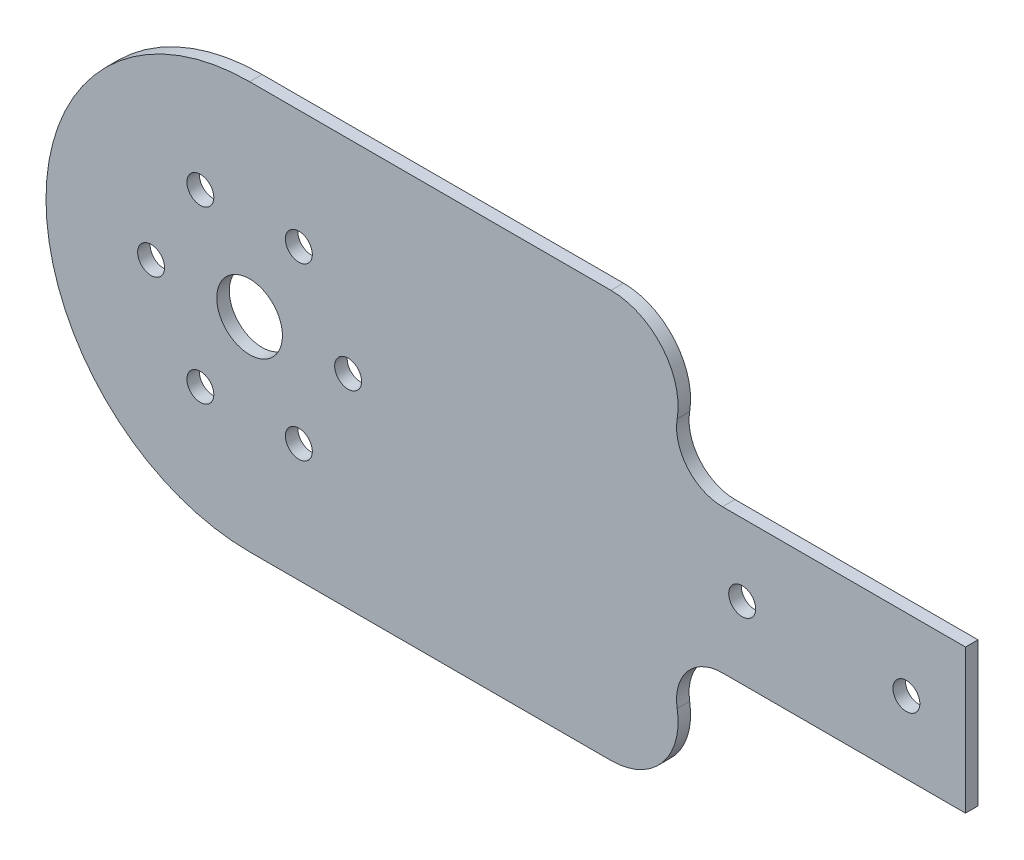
ISO-10303-21;
HEADER;
FILE_DESCRIPTION(('STEP AP214'),'2;1');
FILE_NAME('part.step','',(''),(''),'','','');
FILE_SCHEMA(('AUTOMOTIVE_DESIGN { 1 0 10303 214 1 1 1 1 }'));
ENDSEC;
DATA;
#1=APPLICATION_CONTEXT('core data for automotive mechanical design processes');
#2=APPLICATION_PROTOCOL_DEFINITION('international standard','automotive_design',2000,#1);
#3=PRODUCT_CONTEXT('',#1,'mechanical');
#4=PRODUCT('Part','Part','',(#3));
#5=PRODUCT_RELATED_PRODUCT_CATEGORY('part','',(#4));
#6=PRODUCT_DEFINITION_FORMATION('','',#4);
#7=PRODUCT_DEFINITION_CONTEXT('part definition',#1,'design');
#8=PRODUCT_DEFINITION('design','',#6,#7);
#9=PRODUCT_DEFINITION_SHAPE('','',#8);
#10=(LENGTH_UNIT() NAMED_UNIT(*) SI_UNIT(.MILLI.,.METRE.));
#11=(NAMED_UNIT(*) PLANE_ANGLE_UNIT() SI_UNIT($,.RADIAN.));
#12=(NAMED_UNIT(*) SI_UNIT($,.STERADIAN.) SOLID_ANGLE_UNIT());
#13=UNCERTAINTY_MEASURE_WITH_UNIT(LENGTH_MEASURE(1.E-05),#10,'distance_accuracy_value','');
#14=(GEOMETRIC_REPRESENTATION_CONTEXT(3) GLOBAL_UNCERTAINTY_ASSIGNED_CONTEXT((#13)) GLOBAL_UNIT_ASSIGNED_CONTEXT((#10,
#11,#12)) REPRESENTATION_CONTEXT('',''));
#15=CARTESIAN_POINT('',(0.,0.,0.));
#16=DIRECTION('',(0.,0.,1.));
#17=DIRECTION('',(1.,0.,0.));
#18=AXIS2_PLACEMENT_3D('',#15,#16,#17);
#19=CARTESIAN_POINT('',(0.,0.,1.905));
#20=DIRECTION('',(0.,0.,-1.));
#21=DIRECTION('',(-1.,0.,0.));
#22=AXIS2_PLACEMENT_3D('',#19,#20,#21);
#23=CYLINDRICAL_SURFACE('',#22,31.);
#24=CARTESIAN_POINT('',(0.,0.,0.));
#25=DIRECTION('',(0.,0.,1.));
#26=DIRECTION('',(-1.,0.,0.));
#27=AXIS2_PLACEMENT_3D('',#24,#25,#26);
#28=CIRCLE('',#27,31.);
#29=CARTESIAN_POINT('',(0.,31.,0.));
#30=VERTEX_POINT('',#29);
#31=CARTESIAN_POINT('',(0.,-31.,0.));
#32=VERTEX_POINT('',#31);
#33=EDGE_CURVE('E160',#30,#32,#28,.T.);
#34=ORIENTED_EDGE('',*,*,#33,.T.);
#35=DIRECTION('',(0.,0.,-1.));
#36=VECTOR('',#35,1.);
#37=CARTESIAN_POINT('',(0.,-31.,1.905));
#38=LINE('',#37,#36);
#39=CARTESIAN_POINT('',(0.,-31.,1.905));
#40=VERTEX_POINT('',#39);
#41=EDGE_CURVE('E11',#40,#32,#38,.T.);
#42=ORIENTED_EDGE('',*,*,#41,.F.);
#43=CARTESIAN_POINT('',(0.,0.,1.905));
#44=DIRECTION('',(0.,0.,1.));
#45=DIRECTION('',(-1.,0.,0.));
#46=AXIS2_PLACEMENT_3D('',#43,#44,#45);
#47=CIRCLE('',#46,31.);
#48=CARTESIAN_POINT('',(0.,31.,1.905));
#49=VERTEX_POINT('',#48);
#50=EDGE_CURVE('E187',#49,#40,#47,.T.);
#51=ORIENTED_EDGE('',*,*,#50,.F.);
#52=DIRECTION('',(0.,0.,-1.));
#53=VECTOR('',#52,1.);
#54=CARTESIAN_POINT('',(0.,31.,1.905));
#55=LINE('',#54,#53);
#56=EDGE_CURVE('E153',#49,#30,#55,.T.);
#57=ORIENTED_EDGE('',*,*,#56,.T.);
#58=EDGE_LOOP('',(#34,#42,#51,#57));
#59=FACE_BOUND('',#58,.T.);
#60=ADVANCED_FACE('F42',(#59),#23,.T.);
#61=CARTESIAN_POINT('',(0.,-31.,1.905));
#62=DIRECTION('',(0.,1.,0.));
#63=DIRECTION('',(-1.,0.,0.));
#64=AXIS2_PLACEMENT_3D('',#61,#62,#63);
#65=PLANE('',#64);
#66=DIRECTION('',(1.,0.,0.));
#67=VECTOR('',#66,1.);
#68=CARTESIAN_POINT('',(0.,-31.,0.));
#69=LINE('',#68,#67);
#70=CARTESIAN_POINT('',(55.02,-31.,0.));
#71=VERTEX_POINT('',#70);
#72=EDGE_CURVE('E161',#32,#71,#69,.T.);
#73=ORIENTED_EDGE('',*,*,#72,.T.);
#74=DIRECTION('',(0.,0.,-1.));
#75=VECTOR('',#74,1.);
#76=CARTESIAN_POINT('',(55.02,-31.,1.905));
#77=LINE('',#76,#75);
#78=CARTESIAN_POINT('',(55.02,-31.,1.905));
#79=VERTEX_POINT('',#78);
#80=EDGE_CURVE('E52',#79,#71,#77,.T.);
#81=ORIENTED_EDGE('',*,*,#80,.F.);
#82=DIRECTION('',(1.,0.,0.));
#83=VECTOR('',#82,1.);
#84=CARTESIAN_POINT('',(0.,-31.,1.905));
#85=LINE('',#84,#83);
#86=EDGE_CURVE('E109',#40,#79,#85,.T.);
#87=ORIENTED_EDGE('',*,*,#86,.F.);
#88=ORIENTED_EDGE('',*,*,#41,.T.);
#89=EDGE_LOOP('',(#73,#81,#87,#88));
#90=FACE_BOUND('',#89,.T.);
#91=ADVANCED_FACE('F368',(#90),#65,.F.);
#92=CARTESIAN_POINT('',(55.02,-20.7786788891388,1.905));
#93=DIRECTION('',(0.,0.,-1.));
#94=DIRECTION('',(-1.,0.,0.));
#95=AXIS2_PLACEMENT_3D('',#92,#93,#94);
#96=CYLINDRICAL_SURFACE('',#95,10.2213211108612);
#97=CARTESIAN_POINT('',(55.02,-20.7786788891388,0.));
#98=DIRECTION('',(0.,0.,1.));
#99=DIRECTION('',(1.,0.,0.));
#100=AXIS2_PLACEMENT_3D('',#97,#98,#99);
#101=CIRCLE('',#100,10.2213211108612);
#102=CARTESIAN_POINT('',(65.1021843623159,-19.097916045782,0.));
#103=VERTEX_POINT('',#102);
#104=EDGE_CURVE('E164',#71,#103,#101,.T.);
#105=ORIENTED_EDGE('',*,*,#104,.T.);
#106=DIRECTION('',(0.,0.,-1.));
#107=VECTOR('',#106,1.);
#108=CARTESIAN_POINT('',(65.1021843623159,-19.097916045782,1.905));
#109=LINE('',#108,#107);
#110=CARTESIAN_POINT('',(65.1021843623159,-19.097916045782,1.905));
#111=VERTEX_POINT('',#110);
#112=EDGE_CURVE('E202',#111,#103,#109,.T.);
#113=ORIENTED_EDGE('',*,*,#112,.F.);
#114=CARTESIAN_POINT('',(55.02,-20.7786788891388,1.905));
#115=DIRECTION('',(0.,0.,1.));
#116=DIRECTION('',(1.,0.,0.));
#117=AXIS2_PLACEMENT_3D('',#114,#115,#116);
#118=CIRCLE('',#117,10.2213211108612);
#119=EDGE_CURVE('E214',#79,#111,#118,.T.);
#120=ORIENTED_EDGE('',*,*,#119,.F.);
#121=ORIENTED_EDGE('',*,*,#80,.T.);
#122=EDGE_LOOP('',(#105,#113,#120,#121));
#123=FACE_BOUND('',#122,.T.);
#124=ADVANCED_FACE('F213',(#123),#96,.T.);
#125=CARTESIAN_POINT('',(72.,-17.94800727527,1.905));
#126=DIRECTION('',(0.,0.,-1.));
#127=DIRECTION('',(-1.,0.,0.));
#128=AXIS2_PLACEMENT_3D('',#125,#126,#127);
#129=CYLINDRICAL_SURFACE('',#128,6.99300727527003);
#130=CARTESIAN_POINT('',(72.,-17.94800727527,0.));
#131=DIRECTION('',(0.,0.,-1.));
#132=DIRECTION('',(-1.,0.,0.));
#133=AXIS2_PLACEMENT_3D('',#130,#131,#132);
#134=CIRCLE('',#133,6.99300727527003);
#135=CARTESIAN_POINT('',(72.,-10.955,0.));
#136=VERTEX_POINT('',#135);
#137=EDGE_CURVE('E169',#103,#136,#134,.T.);
#138=ORIENTED_EDGE('',*,*,#137,.T.);
#139=DIRECTION('',(0.,0.,-1.));
#140=VECTOR('',#139,1.);
#141=CARTESIAN_POINT('',(72.,-10.955,1.905));
#142=LINE('',#141,#140);
#143=CARTESIAN_POINT('',(72.,-10.955,1.905));
#144=VERTEX_POINT('',#143);
#145=EDGE_CURVE('E203',#144,#136,#142,.T.);
#146=ORIENTED_EDGE('',*,*,#145,.F.);
#147=CARTESIAN_POINT('',(72.,-17.94800727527,1.905));
#148=DIRECTION('',(0.,0.,-1.));
#149=DIRECTION('',(-1.,0.,0.));
#150=AXIS2_PLACEMENT_3D('',#147,#148,#149);
#151=CIRCLE('',#150,6.99300727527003);
#152=EDGE_CURVE('E232',#111,#144,#151,.T.);
#153=ORIENTED_EDGE('',*,*,#152,.F.);
#154=ORIENTED_EDGE('',*,*,#112,.T.);
#155=EDGE_LOOP('',(#138,#146,#153,#154));
#156=FACE_BOUND('',#155,.T.);
#157=ADVANCED_FACE('F221',(#156),#129,.F.);
#158=CARTESIAN_POINT('',(72.,-10.955,1.905));
#159=DIRECTION('',(0.,1.,0.));
#160=DIRECTION('',(-1.,0.,0.));
#161=AXIS2_PLACEMENT_3D('',#158,#159,#160);
#162=PLANE('',#161);
#163=DIRECTION('',(1.,0.,0.));
#164=VECTOR('',#163,1.);
#165=CARTESIAN_POINT('',(72.,-10.955,0.));
#166=LINE('',#165,#164);
#167=CARTESIAN_POINT('',(109.,-10.955,0.));
#168=VERTEX_POINT('',#167);
#169=EDGE_CURVE('E172',#136,#168,#166,.T.);
#170=ORIENTED_EDGE('',*,*,#169,.T.);
#171=DIRECTION('',(0.,0.,-1.));
#172=VECTOR('',#171,1.);
#173=CARTESIAN_POINT('',(109.,-10.955,1.905));
#174=LINE('',#173,#172);
#175=CARTESIAN_POINT('',(109.,-10.955,1.905));
#176=VERTEX_POINT('',#175);
#177=EDGE_CURVE('E197',#176,#168,#174,.T.);
#178=ORIENTED_EDGE('',*,*,#177,.F.);
#179=DIRECTION('',(1.,0.,0.));
#180=VECTOR('',#179,1.);
#181=CARTESIAN_POINT('',(72.,-10.955,1.905));
#182=LINE('',#181,#180);
#183=EDGE_CURVE('E228',#144,#176,#182,.T.);
#184=ORIENTED_EDGE('',*,*,#183,.F.);
#185=ORIENTED_EDGE('',*,*,#145,.T.);
#186=EDGE_LOOP('',(#170,#178,#184,#185));
#187=FACE_BOUND('',#186,.T.);
#188=ADVANCED_FACE('F229',(#187),#162,.F.);
#189=CARTESIAN_POINT('',(109.,-10.955,1.905));
#190=DIRECTION('',(-1.,0.,0.));
#191=DIRECTION('',(0.,0.,1.));
#192=AXIS2_PLACEMENT_3D('',#189,#190,#191);
#193=PLANE('',#192);
#194=DIRECTION('',(0.,1.,0.));
#195=VECTOR('',#194,1.);
#196=CARTESIAN_POINT('',(109.,-10.955,0.));
#197=LINE('',#196,#195);
#198=CARTESIAN_POINT('',(109.,10.955,0.));
#199=VERTEX_POINT('',#198);
#200=EDGE_CURVE('E171',#168,#199,#197,.T.);
#201=ORIENTED_EDGE('',*,*,#200,.T.);
#202=DIRECTION('',(0.,0.,-1.));
#203=VECTOR('',#202,1.);
#204=CARTESIAN_POINT('',(109.,10.955,1.905));
#205=LINE('',#204,#203);
#206=CARTESIAN_POINT('',(109.,10.955,1.905));
#207=VERTEX_POINT('',#206);
#208=EDGE_CURVE('E191',#207,#199,#205,.T.);
#209=ORIENTED_EDGE('',*,*,#208,.F.);
#210=DIRECTION('',(0.,1.,0.));
#211=VECTOR('',#210,1.);
#212=CARTESIAN_POINT('',(109.,-10.955,1.905));
#213=LINE('',#212,#211);
#214=EDGE_CURVE('E231',#176,#207,#213,.T.);
#215=ORIENTED_EDGE('',*,*,#214,.F.);
#216=ORIENTED_EDGE('',*,*,#177,.T.);
#217=EDGE_LOOP('',(#201,#209,#215,#216));
#218=FACE_BOUND('',#217,.T.);
#219=ADVANCED_FACE('F378',(#218),#193,.F.);
#220=CARTESIAN_POINT('',(109.,10.955,1.905));
#221=DIRECTION('',(0.,-1.,0.));
#222=DIRECTION('',(1.,0.,0.));
#223=AXIS2_PLACEMENT_3D('',#220,#221,#222);
#224=PLANE('',#223);
#225=DIRECTION('',(-1.,0.,0.));
#226=VECTOR('',#225,1.);
#227=CARTESIAN_POINT('',(109.,10.955,0.));
#228=LINE('',#227,#226);
#229=CARTESIAN_POINT('',(72.,10.955,0.));
#230=VERTEX_POINT('',#229);
#231=EDGE_CURVE('E180',#199,#230,#228,.T.);
#232=ORIENTED_EDGE('',*,*,#231,.T.);
#233=DIRECTION('',(0.,0.,-1.));
#234=VECTOR('',#233,1.);
#235=CARTESIAN_POINT('',(72.,10.955,1.905));
#236=LINE('',#235,#234);
#237=CARTESIAN_POINT('',(72.,10.955,1.905));
#238=VERTEX_POINT('',#237);
#239=EDGE_CURVE('E148',#238,#230,#236,.T.);
#240=ORIENTED_EDGE('',*,*,#239,.F.);
#241=DIRECTION('',(-1.,0.,0.));
#242=VECTOR('',#241,1.);
#243=CARTESIAN_POINT('',(109.,10.955,1.905));
#244=LINE('',#243,#242);
#245=EDGE_CURVE('E133',#207,#238,#244,.T.);
#246=ORIENTED_EDGE('',*,*,#245,.F.);
#247=ORIENTED_EDGE('',*,*,#208,.T.);
#248=EDGE_LOOP('',(#232,#240,#246,#247));
#249=FACE_BOUND('',#248,.T.);
#250=ADVANCED_FACE('F374',(#249),#224,.F.);
#251=CARTESIAN_POINT('',(72.,17.94800727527,1.905));
#252=DIRECTION('',(0.,0.,-1.));
#253=DIRECTION('',(-1.,0.,0.));
#254=AXIS2_PLACEMENT_3D('',#251,#252,#253);
#255=CYLINDRICAL_SURFACE('',#254,6.99300727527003);
#256=CARTESIAN_POINT('',(72.,17.94800727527,0.));
#257=DIRECTION('',(0.,0.,-1.));
#258=DIRECTION('',(-1.,0.,0.));
#259=AXIS2_PLACEMENT_3D('',#256,#257,#258);
#260=CIRCLE('',#259,6.99300727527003);
#261=CARTESIAN_POINT('',(65.1021843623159,19.097916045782,0.));
#262=VERTEX_POINT('',#261);
#263=EDGE_CURVE('E145',#230,#262,#260,.T.);
#264=ORIENTED_EDGE('',*,*,#263,.T.);
#265=DIRECTION('',(0.,0.,-1.));
#266=VECTOR('',#265,1.);
#267=CARTESIAN_POINT('',(65.1021843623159,19.097916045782,1.905));
#268=LINE('',#267,#266);
#269=CARTESIAN_POINT('',(65.1021843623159,19.097916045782,1.905));
#270=VERTEX_POINT('',#269);
#271=EDGE_CURVE('E143',#270,#262,#268,.T.);
#272=ORIENTED_EDGE('',*,*,#271,.F.);
#273=CARTESIAN_POINT('',(72.,17.94800727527,1.905));
#274=DIRECTION('',(0.,0.,-1.));
#275=DIRECTION('',(-1.,0.,0.));
#276=AXIS2_PLACEMENT_3D('',#273,#274,#275);
#277=CIRCLE('',#276,6.99300727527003);
#278=EDGE_CURVE('E129',#238,#270,#277,.T.);
#279=ORIENTED_EDGE('',*,*,#278,.F.);
#280=ORIENTED_EDGE('',*,*,#239,.T.);
#281=EDGE_LOOP('',(#264,#272,#279,#280));
#282=FACE_BOUND('',#281,.T.);
#283=ADVANCED_FACE('F142',(#282),#255,.F.);
#284=CARTESIAN_POINT('',(55.02,20.7786788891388,1.905));
#285=DIRECTION('',(0.,0.,-1.));
#286=DIRECTION('',(-1.,0.,0.));
#287=AXIS2_PLACEMENT_3D('',#284,#285,#286);
#288=CYLINDRICAL_SURFACE('',#287,10.2213211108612);
#289=CARTESIAN_POINT('',(55.02,20.7786788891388,0.));
#290=DIRECTION('',(0.,0.,1.));
#291=DIRECTION('',(-1.,0.,0.));
#292=AXIS2_PLACEMENT_3D('',#289,#290,#291);
#293=CIRCLE('',#292,10.2213211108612);
#294=CARTESIAN_POINT('',(55.02,31.,0.));
#295=VERTEX_POINT('',#294);
#296=EDGE_CURVE('E96',#262,#295,#293,.T.);
#297=ORIENTED_EDGE('',*,*,#296,.T.);
#298=DIRECTION('',(0.,0.,-1.));
#299=VECTOR('',#298,1.);
#300=CARTESIAN_POINT('',(55.02,31.,1.905));
#301=LINE('',#300,#299);
#302=CARTESIAN_POINT('',(55.02,31.,1.905));
#303=VERTEX_POINT('',#302);
#304=EDGE_CURVE('E150',#303,#295,#301,.T.);
#305=ORIENTED_EDGE('',*,*,#304,.F.);
#306=CARTESIAN_POINT('',(55.02,20.7786788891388,1.905));
#307=DIRECTION('',(0.,0.,1.));
#308=DIRECTION('',(-1.,0.,0.));
#309=AXIS2_PLACEMENT_3D('',#306,#307,#308);
#310=CIRCLE('',#309,10.2213211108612);
#311=EDGE_CURVE('E134',#270,#303,#310,.T.);
#312=ORIENTED_EDGE('',*,*,#311,.F.);
#313=ORIENTED_EDGE('',*,*,#271,.T.);
#314=EDGE_LOOP('',(#297,#305,#312,#313));
#315=FACE_BOUND('',#314,.T.);
#316=ADVANCED_FACE('F149',(#315),#288,.T.);
#317=CARTESIAN_POINT('',(55.02,31.,1.905));
#318=DIRECTION('',(0.,-1.,0.));
#319=DIRECTION('',(0.,0.,-1.));
#320=AXIS2_PLACEMENT_3D('',#317,#318,#319);
#321=PLANE('',#320);
#322=DIRECTION('',(-1.,0.,0.));
#323=VECTOR('',#322,1.);
#324=CARTESIAN_POINT('',(55.02,31.,0.));
#325=LINE('',#324,#323);
#326=EDGE_CURVE('E105',#295,#30,#325,.T.);
#327=ORIENTED_EDGE('',*,*,#326,.T.);
#328=ORIENTED_EDGE('',*,*,#56,.F.);
#329=DIRECTION('',(-1.,0.,0.));
#330=VECTOR('',#329,1.);
#331=CARTESIAN_POINT('',(55.02,31.,1.905));
#332=LINE('',#331,#330);
#333=EDGE_CURVE('E62',#303,#49,#332,.T.);
#334=ORIENTED_EDGE('',*,*,#333,.F.);
#335=ORIENTED_EDGE('',*,*,#304,.T.);
#336=EDGE_LOOP('',(#327,#328,#334,#335));
#337=FACE_BOUND('',#336,.T.);
#338=ADVANCED_FACE('F332',(#337),#321,.F.);
#339=CARTESIAN_POINT('',(0.,0.,1.905));
#340=DIRECTION('',(0.,0.,-1.));
#341=DIRECTION('',(-1.,0.,0.));
#342=AXIS2_PLACEMENT_3D('',#339,#340,#341);
#343=PLANE('',#342);
#344=CARTESIAN_POINT('',(0.,0.,1.905));
#345=DIRECTION('',(0.,0.,1.));
#346=DIRECTION('',(1.,0.,0.));
#347=AXIS2_PLACEMENT_3D('',#344,#345,#346);
#348=CIRCLE('',#347,5.);
#349=CARTESIAN_POINT('',(5.,0.,1.905));
#350=VERTEX_POINT('',#349);
#351=EDGE_CURVE('E315',#350,#350,#348,.T.);
#352=ORIENTED_EDGE('',*,*,#351,.F.);
#353=EDGE_LOOP('',(#352));
#354=FACE_BOUND('',#353,.T.);
#355=CARTESIAN_POINT('',(-15.,0.,1.905));
#356=DIRECTION('',(0.,0.,1.));
#357=DIRECTION('',(1.,0.,0.));
#358=AXIS2_PLACEMENT_3D('',#355,#356,#357);
#359=CIRCLE('',#358,2.05);
#360=CARTESIAN_POINT('',(-12.95,0.,1.905));
#361=VERTEX_POINT('',#360);
#362=EDGE_CURVE('E264',#361,#361,#359,.T.);
#363=ORIENTED_EDGE('',*,*,#362,.F.);
#364=EDGE_LOOP('',(#363));
#365=FACE_BOUND('',#364,.T.);
#366=CARTESIAN_POINT('',(75.,-1.02887962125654E-13,1.905));
#367=DIRECTION('',(0.,0.,1.));
#368=DIRECTION('',(1.,0.,0.));
#369=AXIS2_PLACEMENT_3D('',#366,#367,#368);
#370=CIRCLE('',#369,2.04999999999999);
#371=CARTESIAN_POINT('',(77.05,-1.02887962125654E-13,1.905));
#372=VERTEX_POINT('',#371);
#373=EDGE_CURVE('E288',#372,#372,#370,.T.);
#374=ORIENTED_EDGE('',*,*,#373,.F.);
#375=EDGE_LOOP('',(#374));
#376=FACE_BOUND('',#375,.T.);
#377=CARTESIAN_POINT('',(-7.50000000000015,-12.9903810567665,1.905));
#378=DIRECTION('',(0.,0.,1.));
#379=DIRECTION('',(1.,0.,0.));
#380=AXIS2_PLACEMENT_3D('',#377,#378,#379);
#381=CIRCLE('',#380,2.05);
#382=CARTESIAN_POINT('',(-5.45000000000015,-12.9903810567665,1.905));
#383=VERTEX_POINT('',#382);
#384=EDGE_CURVE('E293',#383,#383,#381,.T.);
#385=ORIENTED_EDGE('',*,*,#384,.F.);
#386=EDGE_LOOP('',(#385));
#387=FACE_BOUND('',#386,.T.);
#388=CARTESIAN_POINT('',(7.49999999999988,-12.9903810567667,1.905));
#389=DIRECTION('',(0.,0.,1.));
#390=DIRECTION('',(1.,0.,0.));
#391=AXIS2_PLACEMENT_3D('',#388,#389,#390);
#392=CIRCLE('',#391,2.05);
#393=CARTESIAN_POINT('',(9.54999999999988,-12.9903810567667,1.905));
#394=VERTEX_POINT('',#393);
#395=EDGE_CURVE('E271',#394,#394,#392,.T.);
#396=ORIENTED_EDGE('',*,*,#395,.F.);
#397=EDGE_LOOP('',(#396));
#398=FACE_BOUND('',#397,.T.);
#399=CARTESIAN_POINT('',(100.,-1.02907469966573E-13,1.905));
#400=DIRECTION('',(0.,0.,1.));
#401=DIRECTION('',(1.,0.,0.));
#402=AXIS2_PLACEMENT_3D('',#399,#400,#401);
#403=CIRCLE('',#402,2.04999999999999);
#404=CARTESIAN_POINT('',(102.05,-1.02907469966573E-13,1.905));
#405=VERTEX_POINT('',#404);
#406=EDGE_CURVE('E261',#405,#405,#403,.T.);
#407=ORIENTED_EDGE('',*,*,#406,.F.);
#408=EDGE_LOOP('',(#407));
#409=FACE_BOUND('',#408,.T.);
#410=CARTESIAN_POINT('',(-7.49999999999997,12.9903810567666,1.905));
#411=DIRECTION('',(0.,0.,1.));
#412=DIRECTION('',(1.,0.,0.));
#413=AXIS2_PLACEMENT_3D('',#410,#411,#412);
#414=CIRCLE('',#413,2.05);
#415=CARTESIAN_POINT('',(-5.44999999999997,12.9903810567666,1.905));
#416=VERTEX_POINT('',#415);
#417=EDGE_CURVE('E252',#416,#416,#414,.T.);
#418=ORIENTED_EDGE('',*,*,#417,.F.);
#419=EDGE_LOOP('',(#418));
#420=FACE_BOUND('',#419,.T.);
#421=CARTESIAN_POINT('',(7.50000000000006,12.9903810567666,1.905));
#422=DIRECTION('',(0.,0.,1.));
#423=DIRECTION('',(1.,0.,0.));
#424=AXIS2_PLACEMENT_3D('',#421,#422,#423);
#425=CIRCLE('',#424,2.05);
#426=CARTESIAN_POINT('',(9.55000000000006,12.9903810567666,1.905));
#427=VERTEX_POINT('',#426);
#428=EDGE_CURVE('E251',#427,#427,#425,.T.);
#429=ORIENTED_EDGE('',*,*,#428,.F.);
#430=EDGE_LOOP('',(#429));
#431=FACE_BOUND('',#430,.T.);
#432=CARTESIAN_POINT('',(15.,-1.02907469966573E-13,1.905));
#433=DIRECTION('',(0.,0.,1.));
#434=DIRECTION('',(1.,0.,0.));
#435=AXIS2_PLACEMENT_3D('',#432,#433,#434);
#436=CIRCLE('',#435,2.05);
#437=CARTESIAN_POINT('',(17.05,-1.02907469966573E-13,1.905));
#438=VERTEX_POINT('',#437);
#439=EDGE_CURVE('E269',#438,#438,#436,.T.);
#440=ORIENTED_EDGE('',*,*,#439,.F.);
#441=EDGE_LOOP('',(#440));
#442=FACE_BOUND('',#441,.T.);
#443=ORIENTED_EDGE('',*,*,#50,.T.);
#444=ORIENTED_EDGE('',*,*,#86,.T.);
#445=ORIENTED_EDGE('',*,*,#119,.T.);
#446=ORIENTED_EDGE('',*,*,#152,.T.);
#447=ORIENTED_EDGE('',*,*,#183,.T.);
#448=ORIENTED_EDGE('',*,*,#214,.T.);
#449=ORIENTED_EDGE('',*,*,#245,.T.);
#450=ORIENTED_EDGE('',*,*,#278,.T.);
#451=ORIENTED_EDGE('',*,*,#311,.T.);
#452=ORIENTED_EDGE('',*,*,#333,.T.);
#453=EDGE_LOOP('',(#443,#444,#445,#446,#447,#448,#449,#450,#451,#452));
#454=FACE_BOUND('',#453,.T.);
#455=ADVANCED_FACE('F132',(#354,#365,#376,#387,#398,#409,#420,#431,#442,#454),#343,.F.);
#456=CARTESIAN_POINT('',(0.,0.,0.));
#457=DIRECTION('',(0.,0.,-1.));
#458=DIRECTION('',(-1.,0.,0.));
#459=AXIS2_PLACEMENT_3D('',#456,#457,#458);
#460=PLANE('',#459);
#461=CARTESIAN_POINT('',(0.,0.,0.));
#462=DIRECTION('',(0.,0.,1.));
#463=DIRECTION('',(1.,0.,0.));
#464=AXIS2_PLACEMENT_3D('',#461,#462,#463);
#465=CIRCLE('',#464,5.);
#466=CARTESIAN_POINT('',(5.,0.,0.));
#467=VERTEX_POINT('',#466);
#468=EDGE_CURVE('E290',#467,#467,#465,.T.);
#469=ORIENTED_EDGE('',*,*,#468,.T.);
#470=EDGE_LOOP('',(#469));
#471=FACE_BOUND('',#470,.T.);
#472=CARTESIAN_POINT('',(-15.,0.,0.));
#473=DIRECTION('',(0.,0.,1.));
#474=DIRECTION('',(1.,0.,0.));
#475=AXIS2_PLACEMENT_3D('',#472,#473,#474);
#476=CIRCLE('',#475,2.05);
#477=CARTESIAN_POINT('',(-12.95,0.,0.));
#478=VERTEX_POINT('',#477);
#479=EDGE_CURVE('E165',#478,#478,#476,.T.);
#480=ORIENTED_EDGE('',*,*,#479,.T.);
#481=EDGE_LOOP('',(#480));
#482=FACE_BOUND('',#481,.T.);
#483=CARTESIAN_POINT('',(75.,-1.02887962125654E-13,0.));
#484=DIRECTION('',(0.,0.,1.));
#485=DIRECTION('',(1.,0.,0.));
#486=AXIS2_PLACEMENT_3D('',#483,#484,#485);
#487=CIRCLE('',#486,2.04999999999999);
#488=CARTESIAN_POINT('',(77.05,-1.02887962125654E-13,0.));
#489=VERTEX_POINT('',#488);
#490=EDGE_CURVE('E285',#489,#489,#487,.T.);
#491=ORIENTED_EDGE('',*,*,#490,.T.);
#492=EDGE_LOOP('',(#491));
#493=FACE_BOUND('',#492,.T.);
#494=CARTESIAN_POINT('',(-7.50000000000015,-12.9903810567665,0.));
#495=DIRECTION('',(0.,0.,1.));
#496=DIRECTION('',(1.,0.,0.));
#497=AXIS2_PLACEMENT_3D('',#494,#495,#496);
#498=CIRCLE('',#497,2.05);
#499=CARTESIAN_POINT('',(-5.45000000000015,-12.9903810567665,0.));
#500=VERTEX_POINT('',#499);
#501=EDGE_CURVE('E292',#500,#500,#498,.T.);
#502=ORIENTED_EDGE('',*,*,#501,.T.);
#503=EDGE_LOOP('',(#502));
#504=FACE_BOUND('',#503,.T.);
#505=CARTESIAN_POINT('',(7.49999999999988,-12.9903810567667,0.));
#506=DIRECTION('',(0.,0.,1.));
#507=DIRECTION('',(1.,0.,0.));
#508=AXIS2_PLACEMENT_3D('',#505,#506,#507);
#509=CIRCLE('',#508,2.05);
#510=CARTESIAN_POINT('',(9.54999999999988,-12.9903810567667,0.));
#511=VERTEX_POINT('',#510);
#512=EDGE_CURVE('E296',#511,#511,#509,.T.);
#513=ORIENTED_EDGE('',*,*,#512,.T.);
#514=EDGE_LOOP('',(#513));
#515=FACE_BOUND('',#514,.T.);
#516=CARTESIAN_POINT('',(100.,-1.02907469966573E-13,0.));
#517=DIRECTION('',(0.,0.,1.));
#518=DIRECTION('',(1.,0.,0.));
#519=AXIS2_PLACEMENT_3D('',#516,#517,#518);
#520=CIRCLE('',#519,2.04999999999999);
#521=CARTESIAN_POINT('',(102.05,-1.02907469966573E-13,0.));
#522=VERTEX_POINT('',#521);
#523=EDGE_CURVE('E260',#522,#522,#520,.T.);
#524=ORIENTED_EDGE('',*,*,#523,.T.);
#525=EDGE_LOOP('',(#524));
#526=FACE_BOUND('',#525,.T.);
#527=CARTESIAN_POINT('',(-7.49999999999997,12.9903810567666,0.));
#528=DIRECTION('',(0.,0.,1.));
#529=DIRECTION('',(1.,0.,0.));
#530=AXIS2_PLACEMENT_3D('',#527,#528,#529);
#531=CIRCLE('',#530,2.05);
#532=CARTESIAN_POINT('',(-5.44999999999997,12.9903810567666,0.));
#533=VERTEX_POINT('',#532);
#534=EDGE_CURVE('E246',#533,#533,#531,.T.);
#535=ORIENTED_EDGE('',*,*,#534,.T.);
#536=EDGE_LOOP('',(#535));
#537=FACE_BOUND('',#536,.T.);
#538=CARTESIAN_POINT('',(7.50000000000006,12.9903810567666,0.));
#539=DIRECTION('',(0.,0.,1.));
#540=DIRECTION('',(1.,0.,0.));
#541=AXIS2_PLACEMENT_3D('',#538,#539,#540);
#542=CIRCLE('',#541,2.05);
#543=CARTESIAN_POINT('',(9.55000000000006,12.9903810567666,0.));
#544=VERTEX_POINT('',#543);
#545=EDGE_CURVE('E274',#544,#544,#542,.T.);
#546=ORIENTED_EDGE('',*,*,#545,.T.);
#547=EDGE_LOOP('',(#546));
#548=FACE_BOUND('',#547,.T.);
#549=CARTESIAN_POINT('',(15.,-1.02907469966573E-13,0.));
#550=DIRECTION('',(0.,0.,1.));
#551=DIRECTION('',(1.,0.,0.));
#552=AXIS2_PLACEMENT_3D('',#549,#550,#551);
#553=CIRCLE('',#552,2.05);
#554=CARTESIAN_POINT('',(17.05,-1.02907469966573E-13,0.));
#555=VERTEX_POINT('',#554);
#556=EDGE_CURVE('E266',#555,#555,#553,.T.);
#557=ORIENTED_EDGE('',*,*,#556,.T.);
#558=EDGE_LOOP('',(#557));
#559=FACE_BOUND('',#558,.T.);
#560=ORIENTED_EDGE('',*,*,#33,.F.);
#561=ORIENTED_EDGE('',*,*,#326,.F.);
#562=ORIENTED_EDGE('',*,*,#296,.F.);
#563=ORIENTED_EDGE('',*,*,#263,.F.);
#564=ORIENTED_EDGE('',*,*,#231,.F.);
#565=ORIENTED_EDGE('',*,*,#200,.F.);
#566=ORIENTED_EDGE('',*,*,#169,.F.);
#567=ORIENTED_EDGE('',*,*,#137,.F.);
#568=ORIENTED_EDGE('',*,*,#104,.F.);
#569=ORIENTED_EDGE('',*,*,#72,.F.);
#570=EDGE_LOOP('',(#560,#561,#562,#563,#564,#565,#566,#567,#568,#569));
#571=FACE_BOUND('',#570,.T.);
#572=ADVANCED_FACE('F218',(#471,#482,#493,#504,#515,#526,#537,#548,#559,#571),#460,.T.);
#573=CARTESIAN_POINT('',(15.,-1.02907469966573E-13,0.));
#574=DIRECTION('',(0.,0.,1.));
#575=DIRECTION('',(1.,0.,0.));
#576=AXIS2_PLACEMENT_3D('',#573,#574,#575);
#577=CYLINDRICAL_SURFACE('',#576,2.05);
#578=CARTESIAN_POINT('',(17.05,-1.02907469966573E-13,0.));
#579=CARTESIAN_POINT('',(17.05,-1.02907469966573E-13,0.01984375));
#580=CARTESIAN_POINT('',(17.05,-1.02907469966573E-13,0.0396875));
#581=CARTESIAN_POINT('',(17.05,-1.02907469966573E-13,0.079375));
#582=CARTESIAN_POINT('',(17.05,-1.02907469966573E-13,0.09921875));
#583=CARTESIAN_POINT('',(17.05,-1.02907469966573E-13,0.13890625));
#584=CARTESIAN_POINT('',(17.05,-1.02907469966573E-13,0.15875));
#585=CARTESIAN_POINT('',(17.05,-1.02907469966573E-13,0.1984375));
#586=CARTESIAN_POINT('',(17.05,-1.02907469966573E-13,0.21828125));
#587=CARTESIAN_POINT('',(17.05,-1.02907469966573E-13,0.25796875));
#588=CARTESIAN_POINT('',(17.05,-1.02907469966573E-13,0.2778125));
#589=CARTESIAN_POINT('',(17.05,-1.02907469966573E-13,0.3175));
#590=CARTESIAN_POINT('',(17.05,-1.02907469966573E-13,0.33734375));
#591=CARTESIAN_POINT('',(17.05,-1.02907469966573E-13,0.37703125));
#592=CARTESIAN_POINT('',(17.05,-1.02907469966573E-13,0.396875));
#593=CARTESIAN_POINT('',(17.05,-1.02907469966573E-13,0.4365625));
#594=CARTESIAN_POINT('',(17.05,-1.02907469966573E-13,0.45640625));
#595=CARTESIAN_POINT('',(17.05,-1.02907469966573E-13,0.49609375));
#596=CARTESIAN_POINT('',(17.05,-1.02907469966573E-13,0.5159375));
#597=CARTESIAN_POINT('',(17.05,-1.02907469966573E-13,0.555625));
#598=CARTESIAN_POINT('',(17.05,-1.02907469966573E-13,0.57546875));
#599=CARTESIAN_POINT('',(17.05,-1.02907469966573E-13,0.61515625));
#600=CARTESIAN_POINT('',(17.05,-1.02907469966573E-13,0.635));
#601=CARTESIAN_POINT('',(17.05,-1.02907469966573E-13,0.6746875));
#602=CARTESIAN_POINT('',(17.05,-1.02907469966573E-13,0.69453125));
#603=CARTESIAN_POINT('',(17.05,-1.02907469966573E-13,0.73421875));
#604=CARTESIAN_POINT('',(17.05,-1.02907469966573E-13,0.7540625));
#605=CARTESIAN_POINT('',(17.05,-1.02907469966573E-13,0.79375));
#606=CARTESIAN_POINT('',(17.05,-1.02907469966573E-13,0.81359375));
#607=CARTESIAN_POINT('',(17.05,-1.02907469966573E-13,0.85328125));
#608=CARTESIAN_POINT('',(17.05,-1.02907469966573E-13,0.873125));
#609=CARTESIAN_POINT('',(17.05,-1.02907469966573E-13,0.9128125));
#610=CARTESIAN_POINT('',(17.05,-1.02907469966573E-13,0.93265625));
#611=CARTESIAN_POINT('',(17.05,-1.02907469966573E-13,0.97234375));
#612=CARTESIAN_POINT('',(17.05,-1.02907469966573E-13,0.9921875));
#613=CARTESIAN_POINT('',(17.05,-1.02907469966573E-13,1.031875));
#614=CARTESIAN_POINT('',(17.05,-1.02907469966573E-13,1.05171875));
#615=CARTESIAN_POINT('',(17.05,-1.02907469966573E-13,1.09140625));
#616=CARTESIAN_POINT('',(17.05,-1.02907469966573E-13,1.11125));
#617=CARTESIAN_POINT('',(17.05,-1.02907469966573E-13,1.1509375));
#618=CARTESIAN_POINT('',(17.05,-1.02907469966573E-13,1.17078125));
#619=CARTESIAN_POINT('',(17.05,-1.02907469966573E-13,1.21046875));
#620=CARTESIAN_POINT('',(17.05,-1.02907469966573E-13,1.2303125));
#621=CARTESIAN_POINT('',(17.05,-1.02907469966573E-13,1.27));
#622=CARTESIAN_POINT('',(17.05,-1.02907469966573E-13,1.28984375));
#623=CARTESIAN_POINT('',(17.05,-1.02907469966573E-13,1.32953125));
#624=CARTESIAN_POINT('',(17.05,-1.02907469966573E-13,1.349375));
#625=CARTESIAN_POINT('',(17.05,-1.02907469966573E-13,1.3890625));
#626=CARTESIAN_POINT('',(17.05,-1.02907469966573E-13,1.40890625));
#627=CARTESIAN_POINT('',(17.05,-1.02907469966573E-13,1.44859375));
#628=CARTESIAN_POINT('',(17.05,-1.02907469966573E-13,1.4684375));
#629=CARTESIAN_POINT('',(17.05,-1.02907469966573E-13,1.508125));
#630=CARTESIAN_POINT('',(17.05,-1.02907469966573E-13,1.52796875));
#631=CARTESIAN_POINT('',(17.05,-1.02907469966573E-13,1.56765625));
#632=CARTESIAN_POINT('',(17.05,-1.02907469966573E-13,1.5875));
#633=CARTESIAN_POINT('',(17.05,-1.02907469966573E-13,1.6271875));
#634=CARTESIAN_POINT('',(17.05,-1.02907469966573E-13,1.64703125));
#635=CARTESIAN_POINT('',(17.05,-1.02907469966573E-13,1.68671875));
#636=CARTESIAN_POINT('',(17.05,-1.02907469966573E-13,1.7065625));
#637=CARTESIAN_POINT('',(17.05,-1.02907469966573E-13,1.74625));
#638=CARTESIAN_POINT('',(17.05,-1.02907469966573E-13,1.76609375));
#639=CARTESIAN_POINT('',(17.05,-1.02907469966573E-13,1.80578125));
#640=CARTESIAN_POINT('',(17.05,-1.02907469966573E-13,1.825625));
#641=CARTESIAN_POINT('',(17.05,-1.02907469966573E-13,1.8653125));
#642=CARTESIAN_POINT('',(17.05,-1.02907469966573E-13,1.88515625));
#643=CARTESIAN_POINT('',(17.05,-1.02907469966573E-13,1.905));
#644=B_SPLINE_CURVE_WITH_KNOTS('',3,(#578,#579,#580,#581,#582,#583,#584,#585,#586,#587,#588,
#589,#590,#591,#592,#593,#594,#595,#596,#597,#598,#599,#600,#601,#602,#603,#604,#605,#606,#607,
#608,#609,#610,#611,#612,#613,#614,#615,#616,#617,#618,#619,#620,#621,#622,#623,#624,#625,#626,
#627,#628,#629,#630,#631,#632,#633,#634,#635,#636,#637,#638,#639,#640,#641,#642,#643),
.UNSPECIFIED.,.F.,.F.,(4,2,2,2,2,2,2,2,2,2,2,2,2,2,2,2,2,2,2,2,2,2,2,2,2,2,2,2,2,2,2,2,4),(0.,
0.05953125,0.1190625,0.17859375,0.238125,0.29765625,0.3571875,0.41671875,0.47625,0.53578125,
0.5953125,0.65484375,0.714375,0.77390625,0.8334375,0.89296875,0.9525,1.01203125,1.0715625,
1.13109375,1.190625,1.25015625,1.3096875,1.36921875,1.42875,1.48828125,1.5478125,1.60734375,
1.666875,1.72640625,1.7859375,1.84546875,1.905),.UNSPECIFIED.);
#645=EDGE_CURVE('BSEAM349',#555,#438,#644,.T.);
#646=ORIENTED_EDGE('',*,*,#556,.F.);
#647=ORIENTED_EDGE('',*,*,#439,.T.);
#648=ORIENTED_EDGE('',*,*,#645,.T.);
#649=ORIENTED_EDGE('',*,*,#645,.F.);
#650=EDGE_LOOP('',(#646,#648,#647,#649));
#651=FACE_BOUND('',#650,.T.);
#652=ADVANCED_FACE('F349',(#651),#577,.F.);
#653=CARTESIAN_POINT('',(7.50000000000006,12.9903810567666,0.));
#654=DIRECTION('',(0.,0.,1.));
#655=DIRECTION('',(1.,0.,0.));
#656=AXIS2_PLACEMENT_3D('',#653,#654,#655);
#657=CYLINDRICAL_SURFACE('',#656,2.05);
#658=CARTESIAN_POINT('',(9.55000000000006,12.9903810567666,0.));
#659=CARTESIAN_POINT('',(9.55000000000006,12.9903810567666,0.01984375));
#660=CARTESIAN_POINT('',(9.55000000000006,12.9903810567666,0.0396875));
#661=CARTESIAN_POINT('',(9.55000000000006,12.9903810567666,0.079375));
#662=CARTESIAN_POINT('',(9.55000000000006,12.9903810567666,0.09921875));
#663=CARTESIAN_POINT('',(9.55000000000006,12.9903810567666,0.13890625));
#664=CARTESIAN_POINT('',(9.55000000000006,12.9903810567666,0.15875));
#665=CARTESIAN_POINT('',(9.55000000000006,12.9903810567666,0.1984375));
#666=CARTESIAN_POINT('',(9.55000000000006,12.9903810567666,0.21828125));
#667=CARTESIAN_POINT('',(9.55000000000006,12.9903810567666,0.25796875));
#668=CARTESIAN_POINT('',(9.55000000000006,12.9903810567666,0.2778125));
#669=CARTESIAN_POINT('',(9.55000000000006,12.9903810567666,0.3175));
#670=CARTESIAN_POINT('',(9.55000000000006,12.9903810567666,0.33734375));
#671=CARTESIAN_POINT('',(9.55000000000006,12.9903810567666,0.37703125));
#672=CARTESIAN_POINT('',(9.55000000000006,12.9903810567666,0.396875));
#673=CARTESIAN_POINT('',(9.55000000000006,12.9903810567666,0.4365625));
#674=CARTESIAN_POINT('',(9.55000000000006,12.9903810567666,0.45640625));
#675=CARTESIAN_POINT('',(9.55000000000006,12.9903810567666,0.49609375));
#676=CARTESIAN_POINT('',(9.55000000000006,12.9903810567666,0.5159375));
#677=CARTESIAN_POINT('',(9.55000000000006,12.9903810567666,0.555625));
#678=CARTESIAN_POINT('',(9.55000000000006,12.9903810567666,0.57546875));
#679=CARTESIAN_POINT('',(9.55000000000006,12.9903810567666,0.61515625));
#680=CARTESIAN_POINT('',(9.55000000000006,12.9903810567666,0.635));
#681=CARTESIAN_POINT('',(9.55000000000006,12.9903810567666,0.6746875));
#682=CARTESIAN_POINT('',(9.55000000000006,12.9903810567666,0.69453125));
#683=CARTESIAN_POINT('',(9.55000000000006,12.9903810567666,0.73421875));
#684=CARTESIAN_POINT('',(9.55000000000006,12.9903810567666,0.7540625));
#685=CARTESIAN_POINT('',(9.55000000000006,12.9903810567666,0.79375));
#686=CARTESIAN_POINT('',(9.55000000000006,12.9903810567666,0.81359375));
#687=CARTESIAN_POINT('',(9.55000000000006,12.9903810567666,0.85328125));
#688=CARTESIAN_POINT('',(9.55000000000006,12.9903810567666,0.873125));
#689=CARTESIAN_POINT('',(9.55000000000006,12.9903810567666,0.9128125));
#690=CARTESIAN_POINT('',(9.55000000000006,12.9903810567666,0.93265625));
#691=CARTESIAN_POINT('',(9.55000000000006,12.9903810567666,0.97234375));
#692=CARTESIAN_POINT('',(9.55000000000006,12.9903810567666,0.9921875));
#693=CARTESIAN_POINT('',(9.55000000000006,12.9903810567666,1.031875));
#694=CARTESIAN_POINT('',(9.55000000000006,12.9903810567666,1.05171875));
#695=CARTESIAN_POINT('',(9.55000000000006,12.9903810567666,1.09140625));
#696=CARTESIAN_POINT('',(9.55000000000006,12.9903810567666,1.11125));
#697=CARTESIAN_POINT('',(9.55000000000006,12.9903810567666,1.1509375));
#698=CARTESIAN_POINT('',(9.55000000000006,12.9903810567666,1.17078125));
#699=CARTESIAN_POINT('',(9.55000000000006,12.9903810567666,1.21046875));
#700=CARTESIAN_POINT('',(9.55000000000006,12.9903810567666,1.2303125));
#701=CARTESIAN_POINT('',(9.55000000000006,12.9903810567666,1.27));
#702=CARTESIAN_POINT('',(9.55000000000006,12.9903810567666,1.28984375));
#703=CARTESIAN_POINT('',(9.55000000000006,12.9903810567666,1.32953125));
#704=CARTESIAN_POINT('',(9.55000000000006,12.9903810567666,1.349375));
#705=CARTESIAN_POINT('',(9.55000000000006,12.9903810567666,1.3890625));
#706=CARTESIAN_POINT('',(9.55000000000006,12.9903810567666,1.40890625));
#707=CARTESIAN_POINT('',(9.55000000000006,12.9903810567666,1.44859375));
#708=CARTESIAN_POINT('',(9.55000000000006,12.9903810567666,1.4684375));
#709=CARTESIAN_POINT('',(9.55000000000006,12.9903810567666,1.508125));
#710=CARTESIAN_POINT('',(9.55000000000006,12.9903810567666,1.52796875));
#711=CARTESIAN_POINT('',(9.55000000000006,12.9903810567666,1.56765625));
#712=CARTESIAN_POINT('',(9.55000000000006,12.9903810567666,1.5875));
#713=CARTESIAN_POINT('',(9.55000000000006,12.9903810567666,1.6271875));
#714=CARTESIAN_POINT('',(9.55000000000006,12.9903810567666,1.64703125));
#715=CARTESIAN_POINT('',(9.55000000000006,12.9903810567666,1.68671875));
#716=CARTESIAN_POINT('',(9.55000000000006,12.9903810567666,1.7065625));
#717=CARTESIAN_POINT('',(9.55000000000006,12.9903810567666,1.74625));
#718=CARTESIAN_POINT('',(9.55000000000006,12.9903810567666,1.76609375));
#719=CARTESIAN_POINT('',(9.55000000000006,12.9903810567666,1.80578125));
#720=CARTESIAN_POINT('',(9.55000000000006,12.9903810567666,1.825625));
#721=CARTESIAN_POINT('',(9.55000000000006,12.9903810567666,1.8653125));
#722=CARTESIAN_POINT('',(9.55000000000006,12.9903810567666,1.88515625));
#723=CARTESIAN_POINT('',(9.55000000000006,12.9903810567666,1.905));
#724=B_SPLINE_CURVE_WITH_KNOTS('',3,(#658,#659,#660,#661,#662,#663,#664,#665,#666,#667,#668,
#669,#670,#671,#672,#673,#674,#675,#676,#677,#678,#679,#680,#681,#682,#683,#684,#685,#686,#687,
#688,#689,#690,#691,#692,#693,#694,#695,#696,#697,#698,#699,#700,#701,#702,#703,#704,#705,#706,
#707,#708,#709,#710,#711,#712,#713,#714,#715,#716,#717,#718,#719,#720,#721,#722,#723),
.UNSPECIFIED.,.F.,.F.,(4,2,2,2,2,2,2,2,2,2,2,2,2,2,2,2,2,2,2,2,2,2,2,2,2,2,2,2,2,2,2,2,4),(0.,
0.05953125,0.1190625,0.17859375,0.238125,0.29765625,0.3571875,0.41671875,0.47625,0.53578125,
0.5953125,0.65484375,0.714375,0.77390625,0.8334375,0.89296875,0.9525,1.01203125,1.0715625,
1.13109375,1.190625,1.25015625,1.3096875,1.36921875,1.42875,1.48828125,1.5478125,1.60734375,
1.666875,1.72640625,1.7859375,1.84546875,1.905),.UNSPECIFIED.);
#725=EDGE_CURVE('BSEAM352',#544,#427,#724,.T.);
#726=ORIENTED_EDGE('',*,*,#545,.F.);
#727=ORIENTED_EDGE('',*,*,#428,.T.);
#728=ORIENTED_EDGE('',*,*,#725,.T.);
#729=ORIENTED_EDGE('',*,*,#725,.F.);
#730=EDGE_LOOP('',(#726,#728,#727,#729));
#731=FACE_BOUND('',#730,.T.);
#732=ADVANCED_FACE('F352',(#731),#657,.F.);
#733=CARTESIAN_POINT('',(-7.49999999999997,12.9903810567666,0.));
#734=DIRECTION('',(0.,0.,1.));
#735=DIRECTION('',(1.,0.,0.));
#736=AXIS2_PLACEMENT_3D('',#733,#734,#735);
#737=CYLINDRICAL_SURFACE('',#736,2.05);
#738=CARTESIAN_POINT('',(-5.44999999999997,12.9903810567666,0.));
#739=CARTESIAN_POINT('',(-5.44999999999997,12.9903810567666,0.01984375));
#740=CARTESIAN_POINT('',(-5.44999999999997,12.9903810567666,0.0396875));
#741=CARTESIAN_POINT('',(-5.44999999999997,12.9903810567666,0.079375));
#742=CARTESIAN_POINT('',(-5.44999999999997,12.9903810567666,0.09921875));
#743=CARTESIAN_POINT('',(-5.44999999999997,12.9903810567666,0.13890625));
#744=CARTESIAN_POINT('',(-5.44999999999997,12.9903810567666,0.15875));
#745=CARTESIAN_POINT('',(-5.44999999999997,12.9903810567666,0.1984375));
#746=CARTESIAN_POINT('',(-5.44999999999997,12.9903810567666,0.21828125));
#747=CARTESIAN_POINT('',(-5.44999999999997,12.9903810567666,0.25796875));
#748=CARTESIAN_POINT('',(-5.44999999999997,12.9903810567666,0.2778125));
#749=CARTESIAN_POINT('',(-5.44999999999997,12.9903810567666,0.3175));
#750=CARTESIAN_POINT('',(-5.44999999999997,12.9903810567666,0.33734375));
#751=CARTESIAN_POINT('',(-5.44999999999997,12.9903810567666,0.37703125));
#752=CARTESIAN_POINT('',(-5.44999999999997,12.9903810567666,0.396875));
#753=CARTESIAN_POINT('',(-5.44999999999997,12.9903810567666,0.4365625));
#754=CARTESIAN_POINT('',(-5.44999999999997,12.9903810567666,0.45640625));
#755=CARTESIAN_POINT('',(-5.44999999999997,12.9903810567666,0.49609375));
#756=CARTESIAN_POINT('',(-5.44999999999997,12.9903810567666,0.5159375));
#757=CARTESIAN_POINT('',(-5.44999999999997,12.9903810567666,0.555625));
#758=CARTESIAN_POINT('',(-5.44999999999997,12.9903810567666,0.57546875));
#759=CARTESIAN_POINT('',(-5.44999999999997,12.9903810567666,0.61515625));
#760=CARTESIAN_POINT('',(-5.44999999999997,12.9903810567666,0.635));
#761=CARTESIAN_POINT('',(-5.44999999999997,12.9903810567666,0.6746875));
#762=CARTESIAN_POINT('',(-5.44999999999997,12.9903810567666,0.69453125));
#763=CARTESIAN_POINT('',(-5.44999999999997,12.9903810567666,0.73421875));
#764=CARTESIAN_POINT('',(-5.44999999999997,12.9903810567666,0.7540625));
#765=CARTESIAN_POINT('',(-5.44999999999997,12.9903810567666,0.79375));
#766=CARTESIAN_POINT('',(-5.44999999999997,12.9903810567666,0.81359375));
#767=CARTESIAN_POINT('',(-5.44999999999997,12.9903810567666,0.85328125));
#768=CARTESIAN_POINT('',(-5.44999999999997,12.9903810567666,0.873125));
#769=CARTESIAN_POINT('',(-5.44999999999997,12.9903810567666,0.9128125));
#770=CARTESIAN_POINT('',(-5.44999999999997,12.9903810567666,0.93265625));
#771=CARTESIAN_POINT('',(-5.44999999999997,12.9903810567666,0.97234375));
#772=CARTESIAN_POINT('',(-5.44999999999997,12.9903810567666,0.9921875));
#773=CARTESIAN_POINT('',(-5.44999999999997,12.9903810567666,1.031875));
#774=CARTESIAN_POINT('',(-5.44999999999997,12.9903810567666,1.05171875));
#775=CARTESIAN_POINT('',(-5.44999999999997,12.9903810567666,1.09140625));
#776=CARTESIAN_POINT('',(-5.44999999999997,12.9903810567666,1.11125));
#777=CARTESIAN_POINT('',(-5.44999999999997,12.9903810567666,1.1509375));
#778=CARTESIAN_POINT('',(-5.44999999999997,12.9903810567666,1.17078125));
#779=CARTESIAN_POINT('',(-5.44999999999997,12.9903810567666,1.21046875));
#780=CARTESIAN_POINT('',(-5.44999999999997,12.9903810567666,1.2303125));
#781=CARTESIAN_POINT('',(-5.44999999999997,12.9903810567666,1.27));
#782=CARTESIAN_POINT('',(-5.44999999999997,12.9903810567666,1.28984375));
#783=CARTESIAN_POINT('',(-5.44999999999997,12.9903810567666,1.32953125));
#784=CARTESIAN_POINT('',(-5.44999999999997,12.9903810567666,1.349375));
#785=CARTESIAN_POINT('',(-5.44999999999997,12.9903810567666,1.3890625));
#786=CARTESIAN_POINT('',(-5.44999999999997,12.9903810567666,1.40890625));
#787=CARTESIAN_POINT('',(-5.44999999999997,12.9903810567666,1.44859375));
#788=CARTESIAN_POINT('',(-5.44999999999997,12.9903810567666,1.4684375));
#789=CARTESIAN_POINT('',(-5.44999999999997,12.9903810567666,1.508125));
#790=CARTESIAN_POINT('',(-5.44999999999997,12.9903810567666,1.52796875));
#791=CARTESIAN_POINT('',(-5.44999999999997,12.9903810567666,1.56765625));
#792=CARTESIAN_POINT('',(-5.44999999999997,12.9903810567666,1.5875));
#793=CARTESIAN_POINT('',(-5.44999999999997,12.9903810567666,1.6271875));
#794=CARTESIAN_POINT('',(-5.44999999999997,12.9903810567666,1.64703125));
#795=CARTESIAN_POINT('',(-5.44999999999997,12.9903810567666,1.68671875));
#796=CARTESIAN_POINT('',(-5.44999999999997,12.9903810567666,1.7065625));
#797=CARTESIAN_POINT('',(-5.44999999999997,12.9903810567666,1.74625));
#798=CARTESIAN_POINT('',(-5.44999999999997,12.9903810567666,1.76609375));
#799=CARTESIAN_POINT('',(-5.44999999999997,12.9903810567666,1.80578125));
#800=CARTESIAN_POINT('',(-5.44999999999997,12.9903810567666,1.825625));
#801=CARTESIAN_POINT('',(-5.44999999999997,12.9903810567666,1.8653125));
#802=CARTESIAN_POINT('',(-5.44999999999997,12.9903810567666,1.88515625));
#803=CARTESIAN_POINT('',(-5.44999999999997,12.9903810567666,1.905));
#804=B_SPLINE_CURVE_WITH_KNOTS('',3,(#738,#739,#740,#741,#742,#743,#744,#745,#746,#747,#748,
#749,#750,#751,#752,#753,#754,#755,#756,#757,#758,#759,#760,#761,#762,#763,#764,#765,#766,#767,
#768,#769,#770,#771,#772,#773,#774,#775,#776,#777,#778,#779,#780,#781,#782,#783,#784,#785,#786,
#787,#788,#789,#790,#791,#792,#793,#794,#795,#796,#797,#798,#799,#800,#801,#802,#803),
.UNSPECIFIED.,.F.,.F.,(4,2,2,2,2,2,2,2,2,2,2,2,2,2,2,2,2,2,2,2,2,2,2,2,2,2,2,2,2,2,2,2,4),(0.,
0.05953125,0.1190625,0.17859375,0.238125,0.29765625,0.3571875,0.41671875,0.47625,0.53578125,
0.5953125,0.65484375,0.714375,0.77390625,0.8334375,0.89296875,0.9525,1.01203125,1.0715625,
1.13109375,1.190625,1.25015625,1.3096875,1.36921875,1.42875,1.48828125,1.5478125,1.60734375,
1.666875,1.72640625,1.7859375,1.84546875,1.905),.UNSPECIFIED.);
#805=EDGE_CURVE('BSEAM356',#533,#416,#804,.T.);
#806=ORIENTED_EDGE('',*,*,#534,.F.);
#807=ORIENTED_EDGE('',*,*,#417,.T.);
#808=ORIENTED_EDGE('',*,*,#805,.T.);
#809=ORIENTED_EDGE('',*,*,#805,.F.);
#810=EDGE_LOOP('',(#806,#808,#807,#809));
#811=FACE_BOUND('',#810,.T.);
#812=ADVANCED_FACE('F356',(#811),#737,.F.);
#813=CARTESIAN_POINT('',(100.,-1.02907469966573E-13,0.));
#814=DIRECTION('',(0.,0.,1.));
#815=DIRECTION('',(1.,0.,0.));
#816=AXIS2_PLACEMENT_3D('',#813,#814,#815);
#817=CYLINDRICAL_SURFACE('',#816,2.04999999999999);
#818=CARTESIAN_POINT('',(102.05,-1.02907469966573E-13,0.));
#819=CARTESIAN_POINT('',(102.05,-1.02907469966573E-13,0.01984375));
#820=CARTESIAN_POINT('',(102.05,-1.02907469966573E-13,0.0396875));
#821=CARTESIAN_POINT('',(102.05,-1.02907469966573E-13,0.079375));
#822=CARTESIAN_POINT('',(102.05,-1.02907469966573E-13,0.09921875));
#823=CARTESIAN_POINT('',(102.05,-1.02907469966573E-13,0.13890625));
#824=CARTESIAN_POINT('',(102.05,-1.02907469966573E-13,0.15875));
#825=CARTESIAN_POINT('',(102.05,-1.02907469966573E-13,0.1984375));
#826=CARTESIAN_POINT('',(102.05,-1.02907469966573E-13,0.21828125));
#827=CARTESIAN_POINT('',(102.05,-1.02907469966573E-13,0.25796875));
#828=CARTESIAN_POINT('',(102.05,-1.02907469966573E-13,0.2778125));
#829=CARTESIAN_POINT('',(102.05,-1.02907469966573E-13,0.3175));
#830=CARTESIAN_POINT('',(102.05,-1.02907469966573E-13,0.33734375));
#831=CARTESIAN_POINT('',(102.05,-1.02907469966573E-13,0.37703125));
#832=CARTESIAN_POINT('',(102.05,-1.02907469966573E-13,0.396875));
#833=CARTESIAN_POINT('',(102.05,-1.02907469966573E-13,0.4365625));
#834=CARTESIAN_POINT('',(102.05,-1.02907469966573E-13,0.45640625));
#835=CARTESIAN_POINT('',(102.05,-1.02907469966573E-13,0.49609375));
#836=CARTESIAN_POINT('',(102.05,-1.02907469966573E-13,0.5159375));
#837=CARTESIAN_POINT('',(102.05,-1.02907469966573E-13,0.555625));
#838=CARTESIAN_POINT('',(102.05,-1.02907469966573E-13,0.57546875));
#839=CARTESIAN_POINT('',(102.05,-1.02907469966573E-13,0.61515625));
#840=CARTESIAN_POINT('',(102.05,-1.02907469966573E-13,0.635));
#841=CARTESIAN_POINT('',(102.05,-1.02907469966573E-13,0.6746875));
#842=CARTESIAN_POINT('',(102.05,-1.02907469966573E-13,0.69453125));
#843=CARTESIAN_POINT('',(102.05,-1.02907469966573E-13,0.73421875));
#844=CARTESIAN_POINT('',(102.05,-1.02907469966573E-13,0.7540625));
#845=CARTESIAN_POINT('',(102.05,-1.02907469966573E-13,0.79375));
#846=CARTESIAN_POINT('',(102.05,-1.02907469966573E-13,0.81359375));
#847=CARTESIAN_POINT('',(102.05,-1.02907469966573E-13,0.85328125));
#848=CARTESIAN_POINT('',(102.05,-1.02907469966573E-13,0.873125));
#849=CARTESIAN_POINT('',(102.05,-1.02907469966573E-13,0.9128125));
#850=CARTESIAN_POINT('',(102.05,-1.02907469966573E-13,0.93265625));
#851=CARTESIAN_POINT('',(102.05,-1.02907469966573E-13,0.97234375));
#852=CARTESIAN_POINT('',(102.05,-1.02907469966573E-13,0.9921875));
#853=CARTESIAN_POINT('',(102.05,-1.02907469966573E-13,1.031875));
#854=CARTESIAN_POINT('',(102.05,-1.02907469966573E-13,1.05171875));
#855=CARTESIAN_POINT('',(102.05,-1.02907469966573E-13,1.09140625));
#856=CARTESIAN_POINT('',(102.05,-1.02907469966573E-13,1.11125));
#857=CARTESIAN_POINT('',(102.05,-1.02907469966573E-13,1.1509375));
#858=CARTESIAN_POINT('',(102.05,-1.02907469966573E-13,1.17078125));
#859=CARTESIAN_POINT('',(102.05,-1.02907469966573E-13,1.21046875));
#860=CARTESIAN_POINT('',(102.05,-1.02907469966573E-13,1.2303125));
#861=CARTESIAN_POINT('',(102.05,-1.02907469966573E-13,1.27));
#862=CARTESIAN_POINT('',(102.05,-1.02907469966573E-13,1.28984375));
#863=CARTESIAN_POINT('',(102.05,-1.02907469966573E-13,1.32953125));
#864=CARTESIAN_POINT('',(102.05,-1.02907469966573E-13,1.349375));
#865=CARTESIAN_POINT('',(102.05,-1.02907469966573E-13,1.3890625));
#866=CARTESIAN_POINT('',(102.05,-1.02907469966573E-13,1.40890625));
#867=CARTESIAN_POINT('',(102.05,-1.02907469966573E-13,1.44859375));
#868=CARTESIAN_POINT('',(102.05,-1.02907469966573E-13,1.4684375));
#869=CARTESIAN_POINT('',(102.05,-1.02907469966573E-13,1.508125));
#870=CARTESIAN_POINT('',(102.05,-1.02907469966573E-13,1.52796875));
#871=CARTESIAN_POINT('',(102.05,-1.02907469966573E-13,1.56765625));
#872=CARTESIAN_POINT('',(102.05,-1.02907469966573E-13,1.5875));
#873=CARTESIAN_POINT('',(102.05,-1.02907469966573E-13,1.6271875));
#874=CARTESIAN_POINT('',(102.05,-1.02907469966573E-13,1.64703125));
#875=CARTESIAN_POINT('',(102.05,-1.02907469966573E-13,1.68671875));
#876=CARTESIAN_POINT('',(102.05,-1.02907469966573E-13,1.7065625));
#877=CARTESIAN_POINT('',(102.05,-1.02907469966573E-13,1.74625));
#878=CARTESIAN_POINT('',(102.05,-1.02907469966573E-13,1.76609375));
#879=CARTESIAN_POINT('',(102.05,-1.02907469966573E-13,1.80578125));
#880=CARTESIAN_POINT('',(102.05,-1.02907469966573E-13,1.825625));
#881=CARTESIAN_POINT('',(102.05,-1.02907469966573E-13,1.8653125));
#882=CARTESIAN_POINT('',(102.05,-1.02907469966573E-13,1.88515625));
#883=CARTESIAN_POINT('',(102.05,-1.02907469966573E-13,1.905));
#884=B_SPLINE_CURVE_WITH_KNOTS('',3,(#818,#819,#820,#821,#822,#823,#824,#825,#826,#827,#828,
#829,#830,#831,#832,#833,#834,#835,#836,#837,#838,#839,#840,#841,#842,#843,#844,#845,#846,#847,
#848,#849,#850,#851,#852,#853,#854,#855,#856,#857,#858,#859,#860,#861,#862,#863,#864,#865,#866,
#867,#868,#869,#870,#871,#872,#873,#874,#875,#876,#877,#878,#879,#880,#881,#882,#883),
.UNSPECIFIED.,.F.,.F.,(4,2,2,2,2,2,2,2,2,2,2,2,2,2,2,2,2,2,2,2,2,2,2,2,2,2,2,2,2,2,2,2,4),(0.,
0.05953125,0.1190625,0.17859375,0.238125,0.29765625,0.3571875,0.41671875,0.47625,0.53578125,
0.5953125,0.65484375,0.714375,0.77390625,0.8334375,0.89296875,0.9525,1.01203125,1.0715625,
1.13109375,1.190625,1.25015625,1.3096875,1.36921875,1.42875,1.48828125,1.5478125,1.60734375,
1.666875,1.72640625,1.7859375,1.84546875,1.905),.UNSPECIFIED.);
#885=EDGE_CURVE('BSEAM473',#522,#405,#884,.T.);
#886=ORIENTED_EDGE('',*,*,#523,.F.);
#887=ORIENTED_EDGE('',*,*,#406,.T.);
#888=ORIENTED_EDGE('',*,*,#885,.T.);
#889=ORIENTED_EDGE('',*,*,#885,.F.);
#890=EDGE_LOOP('',(#886,#888,#887,#889));
#891=FACE_BOUND('',#890,.T.);
#892=ADVANCED_FACE('F473',(#891),#817,.F.);
#893=CARTESIAN_POINT('',(7.49999999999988,-12.9903810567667,0.));
#894=DIRECTION('',(0.,0.,1.));
#895=DIRECTION('',(1.,0.,0.));
#896=AXIS2_PLACEMENT_3D('',#893,#894,#895);
#897=CYLINDRICAL_SURFACE('',#896,2.05);
#898=CARTESIAN_POINT('',(9.54999999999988,-12.9903810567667,0.));
#899=CARTESIAN_POINT('',(9.54999999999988,-12.9903810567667,0.01984375));
#900=CARTESIAN_POINT('',(9.54999999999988,-12.9903810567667,0.0396875));
#901=CARTESIAN_POINT('',(9.54999999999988,-12.9903810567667,0.079375));
#902=CARTESIAN_POINT('',(9.54999999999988,-12.9903810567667,0.09921875));
#903=CARTESIAN_POINT('',(9.54999999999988,-12.9903810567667,0.13890625));
#904=CARTESIAN_POINT('',(9.54999999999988,-12.9903810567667,0.15875));
#905=CARTESIAN_POINT('',(9.54999999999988,-12.9903810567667,0.1984375));
#906=CARTESIAN_POINT('',(9.54999999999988,-12.9903810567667,0.21828125));
#907=CARTESIAN_POINT('',(9.54999999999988,-12.9903810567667,0.25796875));
#908=CARTESIAN_POINT('',(9.54999999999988,-12.9903810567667,0.2778125));
#909=CARTESIAN_POINT('',(9.54999999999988,-12.9903810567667,0.3175));
#910=CARTESIAN_POINT('',(9.54999999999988,-12.9903810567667,0.33734375));
#911=CARTESIAN_POINT('',(9.54999999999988,-12.9903810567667,0.37703125));
#912=CARTESIAN_POINT('',(9.54999999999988,-12.9903810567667,0.396875));
#913=CARTESIAN_POINT('',(9.54999999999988,-12.9903810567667,0.4365625));
#914=CARTESIAN_POINT('',(9.54999999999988,-12.9903810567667,0.45640625));
#915=CARTESIAN_POINT('',(9.54999999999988,-12.9903810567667,0.49609375));
#916=CARTESIAN_POINT('',(9.54999999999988,-12.9903810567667,0.5159375));
#917=CARTESIAN_POINT('',(9.54999999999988,-12.9903810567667,0.555625));
#918=CARTESIAN_POINT('',(9.54999999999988,-12.9903810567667,0.57546875));
#919=CARTESIAN_POINT('',(9.54999999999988,-12.9903810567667,0.61515625));
#920=CARTESIAN_POINT('',(9.54999999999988,-12.9903810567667,0.635));
#921=CARTESIAN_POINT('',(9.54999999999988,-12.9903810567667,0.6746875));
#922=CARTESIAN_POINT('',(9.54999999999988,-12.9903810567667,0.69453125));
#923=CARTESIAN_POINT('',(9.54999999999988,-12.9903810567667,0.73421875));
#924=CARTESIAN_POINT('',(9.54999999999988,-12.9903810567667,0.7540625));
#925=CARTESIAN_POINT('',(9.54999999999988,-12.9903810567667,0.79375));
#926=CARTESIAN_POINT('',(9.54999999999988,-12.9903810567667,0.81359375));
#927=CARTESIAN_POINT('',(9.54999999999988,-12.9903810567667,0.85328125));
#928=CARTESIAN_POINT('',(9.54999999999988,-12.9903810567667,0.873125));
#929=CARTESIAN_POINT('',(9.54999999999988,-12.9903810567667,0.9128125));
#930=CARTESIAN_POINT('',(9.54999999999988,-12.9903810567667,0.93265625));
#931=CARTESIAN_POINT('',(9.54999999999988,-12.9903810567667,0.97234375));
#932=CARTESIAN_POINT('',(9.54999999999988,-12.9903810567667,0.9921875));
#933=CARTESIAN_POINT('',(9.54999999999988,-12.9903810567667,1.031875));
#934=CARTESIAN_POINT('',(9.54999999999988,-12.9903810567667,1.05171875));
#935=CARTESIAN_POINT('',(9.54999999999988,-12.9903810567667,1.09140625));
#936=CARTESIAN_POINT('',(9.54999999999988,-12.9903810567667,1.11125));
#937=CARTESIAN_POINT('',(9.54999999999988,-12.9903810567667,1.1509375));
#938=CARTESIAN_POINT('',(9.54999999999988,-12.9903810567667,1.17078125));
#939=CARTESIAN_POINT('',(9.54999999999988,-12.9903810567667,1.21046875));
#940=CARTESIAN_POINT('',(9.54999999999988,-12.9903810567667,1.2303125));
#941=CARTESIAN_POINT('',(9.54999999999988,-12.9903810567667,1.27));
#942=CARTESIAN_POINT('',(9.54999999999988,-12.9903810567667,1.28984375));
#943=CARTESIAN_POINT('',(9.54999999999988,-12.9903810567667,1.32953125));
#944=CARTESIAN_POINT('',(9.54999999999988,-12.9903810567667,1.349375));
#945=CARTESIAN_POINT('',(9.54999999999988,-12.9903810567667,1.3890625));
#946=CARTESIAN_POINT('',(9.54999999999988,-12.9903810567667,1.40890625));
#947=CARTESIAN_POINT('',(9.54999999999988,-12.9903810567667,1.44859375));
#948=CARTESIAN_POINT('',(9.54999999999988,-12.9903810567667,1.4684375));
#949=CARTESIAN_POINT('',(9.54999999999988,-12.9903810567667,1.508125));
#950=CARTESIAN_POINT('',(9.54999999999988,-12.9903810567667,1.52796875));
#951=CARTESIAN_POINT('',(9.54999999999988,-12.9903810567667,1.56765625));
#952=CARTESIAN_POINT('',(9.54999999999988,-12.9903810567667,1.5875));
#953=CARTESIAN_POINT('',(9.54999999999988,-12.9903810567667,1.6271875));
#954=CARTESIAN_POINT('',(9.54999999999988,-12.9903810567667,1.64703125));
#955=CARTESIAN_POINT('',(9.54999999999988,-12.9903810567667,1.68671875));
#956=CARTESIAN_POINT('',(9.54999999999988,-12.9903810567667,1.7065625));
#957=CARTESIAN_POINT('',(9.54999999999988,-12.9903810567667,1.74625));
#958=CARTESIAN_POINT('',(9.54999999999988,-12.9903810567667,1.76609375));
#959=CARTESIAN_POINT('',(9.54999999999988,-12.9903810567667,1.80578125));
#960=CARTESIAN_POINT('',(9.54999999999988,-12.9903810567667,1.825625));
#961=CARTESIAN_POINT('',(9.54999999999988,-12.9903810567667,1.8653125));
#962=CARTESIAN_POINT('',(9.54999999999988,-12.9903810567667,1.88515625));
#963=CARTESIAN_POINT('',(9.54999999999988,-12.9903810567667,1.905));
#964=B_SPLINE_CURVE_WITH_KNOTS('',3,(#898,#899,#900,#901,#902,#903,#904,#905,#906,#907,#908,
#909,#910,#911,#912,#913,#914,#915,#916,#917,#918,#919,#920,#921,#922,#923,#924,#925,#926,#927,
#928,#929,#930,#931,#932,#933,#934,#935,#936,#937,#938,#939,#940,#941,#942,#943,#944,#945,#946,
#947,#948,#949,#950,#951,#952,#953,#954,#955,#956,#957,#958,#959,#960,#961,#962,#963),
.UNSPECIFIED.,.F.,.F.,(4,2,2,2,2,2,2,2,2,2,2,2,2,2,2,2,2,2,2,2,2,2,2,2,2,2,2,2,2,2,2,2,4),(0.,
0.05953125,0.1190625,0.17859375,0.238125,0.29765625,0.3571875,0.41671875,0.47625,0.53578125,
0.5953125,0.65484375,0.714375,0.77390625,0.8334375,0.89296875,0.9525,1.01203125,1.0715625,
1.13109375,1.190625,1.25015625,1.3096875,1.36921875,1.42875,1.48828125,1.5478125,1.60734375,
1.666875,1.72640625,1.7859375,1.84546875,1.905),.UNSPECIFIED.);
#965=EDGE_CURVE('BSEAM481',#511,#394,#964,.T.);
#966=ORIENTED_EDGE('',*,*,#512,.F.);
#967=ORIENTED_EDGE('',*,*,#395,.T.);
#968=ORIENTED_EDGE('',*,*,#965,.T.);
#969=ORIENTED_EDGE('',*,*,#965,.F.);
#970=EDGE_LOOP('',(#966,#968,#967,#969));
#971=FACE_BOUND('',#970,.T.);
#972=ADVANCED_FACE('F481',(#971),#897,.F.);
#973=CARTESIAN_POINT('',(-7.50000000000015,-12.9903810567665,0.));
#974=DIRECTION('',(0.,0.,1.));
#975=DIRECTION('',(1.,0.,0.));
#976=AXIS2_PLACEMENT_3D('',#973,#974,#975);
#977=CYLINDRICAL_SURFACE('',#976,2.05);
#978=CARTESIAN_POINT('',(-5.45000000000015,-12.9903810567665,0.));
#979=CARTESIAN_POINT('',(-5.45000000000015,-12.9903810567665,0.01984375));
#980=CARTESIAN_POINT('',(-5.45000000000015,-12.9903810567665,0.0396875));
#981=CARTESIAN_POINT('',(-5.45000000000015,-12.9903810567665,0.079375));
#982=CARTESIAN_POINT('',(-5.45000000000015,-12.9903810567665,0.09921875));
#983=CARTESIAN_POINT('',(-5.45000000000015,-12.9903810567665,0.13890625));
#984=CARTESIAN_POINT('',(-5.45000000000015,-12.9903810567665,0.15875));
#985=CARTESIAN_POINT('',(-5.45000000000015,-12.9903810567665,0.1984375));
#986=CARTESIAN_POINT('',(-5.45000000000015,-12.9903810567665,0.21828125));
#987=CARTESIAN_POINT('',(-5.45000000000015,-12.9903810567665,0.25796875));
#988=CARTESIAN_POINT('',(-5.45000000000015,-12.9903810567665,0.2778125));
#989=CARTESIAN_POINT('',(-5.45000000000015,-12.9903810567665,0.3175));
#990=CARTESIAN_POINT('',(-5.45000000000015,-12.9903810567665,0.33734375));
#991=CARTESIAN_POINT('',(-5.45000000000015,-12.9903810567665,0.37703125));
#992=CARTESIAN_POINT('',(-5.45000000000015,-12.9903810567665,0.396875));
#993=CARTESIAN_POINT('',(-5.45000000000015,-12.9903810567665,0.4365625));
#994=CARTESIAN_POINT('',(-5.45000000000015,-12.9903810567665,0.45640625));
#995=CARTESIAN_POINT('',(-5.45000000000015,-12.9903810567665,0.49609375));
#996=CARTESIAN_POINT('',(-5.45000000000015,-12.9903810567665,0.5159375));
#997=CARTESIAN_POINT('',(-5.45000000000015,-12.9903810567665,0.555625));
#998=CARTESIAN_POINT('',(-5.45000000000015,-12.9903810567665,0.57546875));
#999=CARTESIAN_POINT('',(-5.45000000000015,-12.9903810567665,0.61515625));
#1000=CARTESIAN_POINT('',(-5.45000000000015,-12.9903810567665,0.635));
#1001=CARTESIAN_POINT('',(-5.45000000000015,-12.9903810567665,0.6746875));
#1002=CARTESIAN_POINT('',(-5.45000000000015,-12.9903810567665,0.69453125));
#1003=CARTESIAN_POINT('',(-5.45000000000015,-12.9903810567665,0.73421875));
#1004=CARTESIAN_POINT('',(-5.45000000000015,-12.9903810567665,0.7540625));
#1005=CARTESIAN_POINT('',(-5.45000000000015,-12.9903810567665,0.79375));
#1006=CARTESIAN_POINT('',(-5.45000000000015,-12.9903810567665,0.81359375));
#1007=CARTESIAN_POINT('',(-5.45000000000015,-12.9903810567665,0.85328125));
#1008=CARTESIAN_POINT('',(-5.45000000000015,-12.9903810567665,0.873125));
#1009=CARTESIAN_POINT('',(-5.45000000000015,-12.9903810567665,0.9128125));
#1010=CARTESIAN_POINT('',(-5.45000000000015,-12.9903810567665,0.93265625));
#1011=CARTESIAN_POINT('',(-5.45000000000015,-12.9903810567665,0.97234375));
#1012=CARTESIAN_POINT('',(-5.45000000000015,-12.9903810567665,0.9921875));
#1013=CARTESIAN_POINT('',(-5.45000000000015,-12.9903810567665,1.031875));
#1014=CARTESIAN_POINT('',(-5.45000000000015,-12.9903810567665,1.05171875));
#1015=CARTESIAN_POINT('',(-5.45000000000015,-12.9903810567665,1.09140625));
#1016=CARTESIAN_POINT('',(-5.45000000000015,-12.9903810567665,1.11125));
#1017=CARTESIAN_POINT('',(-5.45000000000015,-12.9903810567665,1.1509375));
#1018=CARTESIAN_POINT('',(-5.45000000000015,-12.9903810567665,1.17078125));
#1019=CARTESIAN_POINT('',(-5.45000000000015,-12.9903810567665,1.21046875));
#1020=CARTESIAN_POINT('',(-5.45000000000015,-12.9903810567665,1.2303125));
#1021=CARTESIAN_POINT('',(-5.45000000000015,-12.9903810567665,1.27));
#1022=CARTESIAN_POINT('',(-5.45000000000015,-12.9903810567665,1.28984375));
#1023=CARTESIAN_POINT('',(-5.45000000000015,-12.9903810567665,1.32953125));
#1024=CARTESIAN_POINT('',(-5.45000000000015,-12.9903810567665,1.349375));
#1025=CARTESIAN_POINT('',(-5.45000000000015,-12.9903810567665,1.3890625));
#1026=CARTESIAN_POINT('',(-5.45000000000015,-12.9903810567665,1.40890625));
#1027=CARTESIAN_POINT('',(-5.45000000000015,-12.9903810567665,1.44859375));
#1028=CARTESIAN_POINT('',(-5.45000000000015,-12.9903810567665,1.4684375));
#1029=CARTESIAN_POINT('',(-5.45000000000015,-12.9903810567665,1.508125));
#1030=CARTESIAN_POINT('',(-5.45000000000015,-12.9903810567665,1.52796875));
#1031=CARTESIAN_POINT('',(-5.45000000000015,-12.9903810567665,1.56765625));
#1032=CARTESIAN_POINT('',(-5.45000000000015,-12.9903810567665,1.5875));
#1033=CARTESIAN_POINT('',(-5.45000000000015,-12.9903810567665,1.6271875));
#1034=CARTESIAN_POINT('',(-5.45000000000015,-12.9903810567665,1.64703125));
#1035=CARTESIAN_POINT('',(-5.45000000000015,-12.9903810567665,1.68671875));
#1036=CARTESIAN_POINT('',(-5.45000000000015,-12.9903810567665,1.7065625));
#1037=CARTESIAN_POINT('',(-5.45000000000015,-12.9903810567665,1.74625));
#1038=CARTESIAN_POINT('',(-5.45000000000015,-12.9903810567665,1.76609375));
#1039=CARTESIAN_POINT('',(-5.45000000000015,-12.9903810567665,1.80578125));
#1040=CARTESIAN_POINT('',(-5.45000000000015,-12.9903810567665,1.825625));
#1041=CARTESIAN_POINT('',(-5.45000000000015,-12.9903810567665,1.8653125));
#1042=CARTESIAN_POINT('',(-5.45000000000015,-12.9903810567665,1.88515625));
#1043=CARTESIAN_POINT('',(-5.45000000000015,-12.9903810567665,1.905));
#1044=B_SPLINE_CURVE_WITH_KNOTS('',3,(#978,#979,#980,#981,#982,#983,#984,#985,#986,#987,#988,
#989,#990,#991,#992,#993,#994,#995,#996,#997,#998,#999,#1000,#1001,#1002,#1003,#1004,#1005,
#1006,#1007,#1008,#1009,#1010,#1011,#1012,#1013,#1014,#1015,#1016,#1017,#1018,#1019,#1020,#1021,
#1022,#1023,#1024,#1025,#1026,#1027,#1028,#1029,#1030,#1031,#1032,#1033,#1034,#1035,#1036,#1037,
#1038,#1039,#1040,#1041,#1042,#1043),.UNSPECIFIED.,.F.,.F.,(4,2,2,2,2,2,2,2,2,2,2,2,2,2,2,2,2,2,
2,2,2,2,2,2,2,2,2,2,2,2,2,2,4),(0.,0.05953125,0.1190625,0.17859375,0.238125,0.29765625,
0.3571875,0.41671875,0.47625,0.53578125,0.5953125,0.65484375,0.714375,0.77390625,0.8334375,
0.89296875,0.9525,1.01203125,1.0715625,1.13109375,1.190625,1.25015625,1.3096875,1.36921875,
1.42875,1.48828125,1.5478125,1.60734375,1.666875,1.72640625,1.7859375,1.84546875,1.905),.UNSPECIFIED.);
#1045=EDGE_CURVE('BSEAM489',#500,#383,#1044,.T.);
#1046=ORIENTED_EDGE('',*,*,#501,.F.);
#1047=ORIENTED_EDGE('',*,*,#384,.T.);
#1048=ORIENTED_EDGE('',*,*,#1045,.T.);
#1049=ORIENTED_EDGE('',*,*,#1045,.F.);
#1050=EDGE_LOOP('',(#1046,#1048,#1047,#1049));
#1051=FACE_BOUND('',#1050,.T.);
#1052=ADVANCED_FACE('F489',(#1051),#977,.F.);
#1053=CARTESIAN_POINT('',(75.,-1.02887962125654E-13,0.));
#1054=DIRECTION('',(0.,0.,1.));
#1055=DIRECTION('',(1.,0.,0.));
#1056=AXIS2_PLACEMENT_3D('',#1053,#1054,#1055);
#1057=CYLINDRICAL_SURFACE('',#1056,2.04999999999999);
#1058=CARTESIAN_POINT('',(77.05,-1.02887962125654E-13,0.));
#1059=CARTESIAN_POINT('',(77.05,-1.02887962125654E-13,0.01984375));
#1060=CARTESIAN_POINT('',(77.05,-1.02887962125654E-13,0.0396875));
#1061=CARTESIAN_POINT('',(77.05,-1.02887962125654E-13,0.079375));
#1062=CARTESIAN_POINT('',(77.05,-1.02887962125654E-13,0.09921875));
#1063=CARTESIAN_POINT('',(77.05,-1.02887962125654E-13,0.13890625));
#1064=CARTESIAN_POINT('',(77.05,-1.02887962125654E-13,0.15875));
#1065=CARTESIAN_POINT('',(77.05,-1.02887962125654E-13,0.1984375));
#1066=CARTESIAN_POINT('',(77.05,-1.02887962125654E-13,0.21828125));
#1067=CARTESIAN_POINT('',(77.05,-1.02887962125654E-13,0.25796875));
#1068=CARTESIAN_POINT('',(77.05,-1.02887962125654E-13,0.2778125));
#1069=CARTESIAN_POINT('',(77.05,-1.02887962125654E-13,0.3175));
#1070=CARTESIAN_POINT('',(77.05,-1.02887962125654E-13,0.33734375));
#1071=CARTESIAN_POINT('',(77.05,-1.02887962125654E-13,0.37703125));
#1072=CARTESIAN_POINT('',(77.05,-1.02887962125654E-13,0.396875));
#1073=CARTESIAN_POINT('',(77.05,-1.02887962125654E-13,0.4365625));
#1074=CARTESIAN_POINT('',(77.05,-1.02887962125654E-13,0.45640625));
#1075=CARTESIAN_POINT('',(77.05,-1.02887962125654E-13,0.49609375));
#1076=CARTESIAN_POINT('',(77.05,-1.02887962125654E-13,0.5159375));
#1077=CARTESIAN_POINT('',(77.05,-1.02887962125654E-13,0.555625));
#1078=CARTESIAN_POINT('',(77.05,-1.02887962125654E-13,0.57546875));
#1079=CARTESIAN_POINT('',(77.05,-1.02887962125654E-13,0.61515625));
#1080=CARTESIAN_POINT('',(77.05,-1.02887962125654E-13,0.635));
#1081=CARTESIAN_POINT('',(77.05,-1.02887962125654E-13,0.6746875));
#1082=CARTESIAN_POINT('',(77.05,-1.02887962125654E-13,0.69453125));
#1083=CARTESIAN_POINT('',(77.05,-1.02887962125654E-13,0.73421875));
#1084=CARTESIAN_POINT('',(77.05,-1.02887962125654E-13,0.7540625));
#1085=CARTESIAN_POINT('',(77.05,-1.02887962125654E-13,0.79375));
#1086=CARTESIAN_POINT('',(77.05,-1.02887962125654E-13,0.81359375));
#1087=CARTESIAN_POINT('',(77.05,-1.02887962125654E-13,0.85328125));
#1088=CARTESIAN_POINT('',(77.05,-1.02887962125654E-13,0.873125));
#1089=CARTESIAN_POINT('',(77.05,-1.02887962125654E-13,0.9128125));
#1090=CARTESIAN_POINT('',(77.05,-1.02887962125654E-13,0.93265625));
#1091=CARTESIAN_POINT('',(77.05,-1.02887962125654E-13,0.97234375));
#1092=CARTESIAN_POINT('',(77.05,-1.02887962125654E-13,0.9921875));
#1093=CARTESIAN_POINT('',(77.05,-1.02887962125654E-13,1.031875));
#1094=CARTESIAN_POINT('',(77.05,-1.02887962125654E-13,1.05171875));
#1095=CARTESIAN_POINT('',(77.05,-1.02887962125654E-13,1.09140625));
#1096=CARTESIAN_POINT('',(77.05,-1.02887962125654E-13,1.11125));
#1097=CARTESIAN_POINT('',(77.05,-1.02887962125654E-13,1.1509375));
#1098=CARTESIAN_POINT('',(77.05,-1.02887962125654E-13,1.17078125));
#1099=CARTESIAN_POINT('',(77.05,-1.02887962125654E-13,1.21046875));
#1100=CARTESIAN_POINT('',(77.05,-1.02887962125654E-13,1.2303125));
#1101=CARTESIAN_POINT('',(77.05,-1.02887962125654E-13,1.27));
#1102=CARTESIAN_POINT('',(77.05,-1.02887962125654E-13,1.28984375));
#1103=CARTESIAN_POINT('',(77.05,-1.02887962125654E-13,1.32953125));
#1104=CARTESIAN_POINT('',(77.05,-1.02887962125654E-13,1.349375));
#1105=CARTESIAN_POINT('',(77.05,-1.02887962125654E-13,1.3890625));
#1106=CARTESIAN_POINT('',(77.05,-1.02887962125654E-13,1.40890625));
#1107=CARTESIAN_POINT('',(77.05,-1.02887962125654E-13,1.44859375));
#1108=CARTESIAN_POINT('',(77.05,-1.02887962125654E-13,1.4684375));
#1109=CARTESIAN_POINT('',(77.05,-1.02887962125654E-13,1.508125));
#1110=CARTESIAN_POINT('',(77.05,-1.02887962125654E-13,1.52796875));
#1111=CARTESIAN_POINT('',(77.05,-1.02887962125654E-13,1.56765625));
#1112=CARTESIAN_POINT('',(77.05,-1.02887962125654E-13,1.5875));
#1113=CARTESIAN_POINT('',(77.05,-1.02887962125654E-13,1.6271875));
#1114=CARTESIAN_POINT('',(77.05,-1.02887962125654E-13,1.64703125));
#1115=CARTESIAN_POINT('',(77.05,-1.02887962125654E-13,1.68671875));
#1116=CARTESIAN_POINT('',(77.05,-1.02887962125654E-13,1.7065625));
#1117=CARTESIAN_POINT('',(77.05,-1.02887962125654E-13,1.74625));
#1118=CARTESIAN_POINT('',(77.05,-1.02887962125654E-13,1.76609375));
#1119=CARTESIAN_POINT('',(77.05,-1.02887962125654E-13,1.80578125));
#1120=CARTESIAN_POINT('',(77.05,-1.02887962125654E-13,1.825625));
#1121=CARTESIAN_POINT('',(77.05,-1.02887962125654E-13,1.8653125));
#1122=CARTESIAN_POINT('',(77.05,-1.02887962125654E-13,1.88515625));
#1123=CARTESIAN_POINT('',(77.05,-1.02887962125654E-13,1.905));
#1124=B_SPLINE_CURVE_WITH_KNOTS('',3,(#1058,#1059,#1060,#1061,#1062,#1063,#1064,#1065,#1066,
#1067,#1068,#1069,#1070,#1071,#1072,#1073,#1074,#1075,#1076,#1077,#1078,#1079,#1080,#1081,#1082,
#1083,#1084,#1085,#1086,#1087,#1088,#1089,#1090,#1091,#1092,#1093,#1094,#1095,#1096,#1097,#1098,
#1099,#1100,#1101,#1102,#1103,#1104,#1105,#1106,#1107,#1108,#1109,#1110,#1111,#1112,#1113,#1114,
#1115,#1116,#1117,#1118,#1119,#1120,#1121,#1122,#1123),.UNSPECIFIED.,.F.,.F.,(4,2,2,2,2,2,2,2,2,
2,2,2,2,2,2,2,2,2,2,2,2,2,2,2,2,2,2,2,2,2,2,2,4),(0.,0.05953125,0.1190625,0.17859375,0.238125,
0.29765625,0.3571875,0.41671875,0.47625,0.53578125,0.5953125,0.65484375,0.714375,0.77390625,
0.8334375,0.89296875,0.9525,1.01203125,1.0715625,1.13109375,1.190625,1.25015625,1.3096875,
1.36921875,1.42875,1.48828125,1.5478125,1.60734375,1.666875,1.72640625,1.7859375,1.84546875,
1.905),.UNSPECIFIED.);
#1125=EDGE_CURVE('BSEAM498',#489,#372,#1124,.T.);
#1126=ORIENTED_EDGE('',*,*,#490,.F.);
#1127=ORIENTED_EDGE('',*,*,#373,.T.);
#1128=ORIENTED_EDGE('',*,*,#1125,.T.);
#1129=ORIENTED_EDGE('',*,*,#1125,.F.);
#1130=EDGE_LOOP('',(#1126,#1128,#1127,#1129));
#1131=FACE_BOUND('',#1130,.T.);
#1132=ADVANCED_FACE('F498',(#1131),#1057,.F.);
#1133=CARTESIAN_POINT('',(-15.,0.,0.));
#1134=DIRECTION('',(0.,0.,1.));
#1135=DIRECTION('',(1.,0.,0.));
#1136=AXIS2_PLACEMENT_3D('',#1133,#1134,#1135);
#1137=CYLINDRICAL_SURFACE('',#1136,2.05);
#1138=CARTESIAN_POINT('',(-12.95,0.,0.));
#1139=CARTESIAN_POINT('',(-12.95,0.,0.01984375));
#1140=CARTESIAN_POINT('',(-12.95,0.,0.0396875));
#1141=CARTESIAN_POINT('',(-12.95,0.,0.079375));
#1142=CARTESIAN_POINT('',(-12.95,0.,0.09921875));
#1143=CARTESIAN_POINT('',(-12.95,0.,0.13890625));
#1144=CARTESIAN_POINT('',(-12.95,0.,0.15875));
#1145=CARTESIAN_POINT('',(-12.95,0.,0.1984375));
#1146=CARTESIAN_POINT('',(-12.95,0.,0.21828125));
#1147=CARTESIAN_POINT('',(-12.95,0.,0.25796875));
#1148=CARTESIAN_POINT('',(-12.95,0.,0.2778125));
#1149=CARTESIAN_POINT('',(-12.95,0.,0.3175));
#1150=CARTESIAN_POINT('',(-12.95,0.,0.33734375));
#1151=CARTESIAN_POINT('',(-12.95,0.,0.37703125));
#1152=CARTESIAN_POINT('',(-12.95,0.,0.396875));
#1153=CARTESIAN_POINT('',(-12.95,0.,0.4365625));
#1154=CARTESIAN_POINT('',(-12.95,0.,0.45640625));
#1155=CARTESIAN_POINT('',(-12.95,0.,0.49609375));
#1156=CARTESIAN_POINT('',(-12.95,0.,0.5159375));
#1157=CARTESIAN_POINT('',(-12.95,0.,0.555625));
#1158=CARTESIAN_POINT('',(-12.95,0.,0.57546875));
#1159=CARTESIAN_POINT('',(-12.95,0.,0.61515625));
#1160=CARTESIAN_POINT('',(-12.95,0.,0.635));
#1161=CARTESIAN_POINT('',(-12.95,0.,0.6746875));
#1162=CARTESIAN_POINT('',(-12.95,0.,0.69453125));
#1163=CARTESIAN_POINT('',(-12.95,0.,0.73421875));
#1164=CARTESIAN_POINT('',(-12.95,0.,0.7540625));
#1165=CARTESIAN_POINT('',(-12.95,0.,0.79375));
#1166=CARTESIAN_POINT('',(-12.95,0.,0.81359375));
#1167=CARTESIAN_POINT('',(-12.95,0.,0.85328125));
#1168=CARTESIAN_POINT('',(-12.95,0.,0.873125));
#1169=CARTESIAN_POINT('',(-12.95,0.,0.9128125));
#1170=CARTESIAN_POINT('',(-12.95,0.,0.93265625));
#1171=CARTESIAN_POINT('',(-12.95,0.,0.97234375));
#1172=CARTESIAN_POINT('',(-12.95,0.,0.9921875));
#1173=CARTESIAN_POINT('',(-12.95,0.,1.031875));
#1174=CARTESIAN_POINT('',(-12.95,0.,1.05171875));
#1175=CARTESIAN_POINT('',(-12.95,0.,1.09140625));
#1176=CARTESIAN_POINT('',(-12.95,0.,1.11125));
#1177=CARTESIAN_POINT('',(-12.95,0.,1.1509375));
#1178=CARTESIAN_POINT('',(-12.95,0.,1.17078125));
#1179=CARTESIAN_POINT('',(-12.95,0.,1.21046875));
#1180=CARTESIAN_POINT('',(-12.95,0.,1.2303125));
#1181=CARTESIAN_POINT('',(-12.95,0.,1.27));
#1182=CARTESIAN_POINT('',(-12.95,0.,1.28984375));
#1183=CARTESIAN_POINT('',(-12.95,0.,1.32953125));
#1184=CARTESIAN_POINT('',(-12.95,0.,1.349375));
#1185=CARTESIAN_POINT('',(-12.95,0.,1.3890625));
#1186=CARTESIAN_POINT('',(-12.95,0.,1.40890625));
#1187=CARTESIAN_POINT('',(-12.95,0.,1.44859375));
#1188=CARTESIAN_POINT('',(-12.95,0.,1.4684375));
#1189=CARTESIAN_POINT('',(-12.95,0.,1.508125));
#1190=CARTESIAN_POINT('',(-12.95,0.,1.52796875));
#1191=CARTESIAN_POINT('',(-12.95,0.,1.56765625));
#1192=CARTESIAN_POINT('',(-12.95,0.,1.5875));
#1193=CARTESIAN_POINT('',(-12.95,0.,1.6271875));
#1194=CARTESIAN_POINT('',(-12.95,0.,1.64703125));
#1195=CARTESIAN_POINT('',(-12.95,0.,1.68671875));
#1196=CARTESIAN_POINT('',(-12.95,0.,1.7065625));
#1197=CARTESIAN_POINT('',(-12.95,0.,1.74625));
#1198=CARTESIAN_POINT('',(-12.95,0.,1.76609375));
#1199=CARTESIAN_POINT('',(-12.95,0.,1.80578125));
#1200=CARTESIAN_POINT('',(-12.95,0.,1.825625));
#1201=CARTESIAN_POINT('',(-12.95,0.,1.8653125));
#1202=CARTESIAN_POINT('',(-12.95,0.,1.88515625));
#1203=CARTESIAN_POINT('',(-12.95,0.,1.905));
#1204=B_SPLINE_CURVE_WITH_KNOTS('',3,(#1138,#1139,#1140,#1141,#1142,#1143,#1144,#1145,#1146,
#1147,#1148,#1149,#1150,#1151,#1152,#1153,#1154,#1155,#1156,#1157,#1158,#1159,#1160,#1161,#1162,
#1163,#1164,#1165,#1166,#1167,#1168,#1169,#1170,#1171,#1172,#1173,#1174,#1175,#1176,#1177,#1178,
#1179,#1180,#1181,#1182,#1183,#1184,#1185,#1186,#1187,#1188,#1189,#1190,#1191,#1192,#1193,#1194,
#1195,#1196,#1197,#1198,#1199,#1200,#1201,#1202,#1203),.UNSPECIFIED.,.F.,.F.,(4,2,2,2,2,2,2,2,2,
2,2,2,2,2,2,2,2,2,2,2,2,2,2,2,2,2,2,2,2,2,2,2,4),(0.,0.05953125,0.1190625,0.17859375,0.238125,
0.29765625,0.3571875,0.41671875,0.47625,0.53578125,0.5953125,0.65484375,0.714375,0.77390625,
0.8334375,0.89296875,0.9525,1.01203125,1.0715625,1.13109375,1.190625,1.25015625,1.3096875,
1.36921875,1.42875,1.48828125,1.5478125,1.60734375,1.666875,1.72640625,1.7859375,1.84546875,
1.905),.UNSPECIFIED.);
#1205=EDGE_CURVE('BSEAM324',#478,#361,#1204,.T.);
#1206=ORIENTED_EDGE('',*,*,#479,.F.);
#1207=ORIENTED_EDGE('',*,*,#362,.T.);
#1208=ORIENTED_EDGE('',*,*,#1205,.T.);
#1209=ORIENTED_EDGE('',*,*,#1205,.F.);
#1210=EDGE_LOOP('',(#1206,#1208,#1207,#1209));
#1211=FACE_BOUND('',#1210,.T.);
#1212=ADVANCED_FACE('F324',(#1211),#1137,.F.);
#1213=CARTESIAN_POINT('',(0.,0.,0.));
#1214=DIRECTION('',(0.,0.,1.));
#1215=DIRECTION('',(1.,0.,0.));
#1216=AXIS2_PLACEMENT_3D('',#1213,#1214,#1215);
#1217=CYLINDRICAL_SURFACE('',#1216,5.);
#1218=CARTESIAN_POINT('',(5.,0.,0.));
#1219=CARTESIAN_POINT('',(5.,0.,0.01984375));
#1220=CARTESIAN_POINT('',(5.,0.,0.0396875));
#1221=CARTESIAN_POINT('',(5.,0.,0.079375));
#1222=CARTESIAN_POINT('',(5.,0.,0.09921875));
#1223=CARTESIAN_POINT('',(5.,0.,0.13890625));
#1224=CARTESIAN_POINT('',(5.,0.,0.15875));
#1225=CARTESIAN_POINT('',(5.,0.,0.1984375));
#1226=CARTESIAN_POINT('',(5.,0.,0.21828125));
#1227=CARTESIAN_POINT('',(5.,0.,0.25796875));
#1228=CARTESIAN_POINT('',(5.,0.,0.2778125));
#1229=CARTESIAN_POINT('',(5.,0.,0.3175));
#1230=CARTESIAN_POINT('',(5.,0.,0.33734375));
#1231=CARTESIAN_POINT('',(5.,0.,0.37703125));
#1232=CARTESIAN_POINT('',(5.,0.,0.396875));
#1233=CARTESIAN_POINT('',(5.,0.,0.4365625));
#1234=CARTESIAN_POINT('',(5.,0.,0.45640625));
#1235=CARTESIAN_POINT('',(5.,0.,0.49609375));
#1236=CARTESIAN_POINT('',(5.,0.,0.5159375));
#1237=CARTESIAN_POINT('',(5.,0.,0.555625));
#1238=CARTESIAN_POINT('',(5.,0.,0.57546875));
#1239=CARTESIAN_POINT('',(5.,0.,0.61515625));
#1240=CARTESIAN_POINT('',(5.,0.,0.635));
#1241=CARTESIAN_POINT('',(5.,0.,0.6746875));
#1242=CARTESIAN_POINT('',(5.,0.,0.69453125));
#1243=CARTESIAN_POINT('',(5.,0.,0.73421875));
#1244=CARTESIAN_POINT('',(5.,0.,0.7540625));
#1245=CARTESIAN_POINT('',(5.,0.,0.79375));
#1246=CARTESIAN_POINT('',(5.,0.,0.81359375));
#1247=CARTESIAN_POINT('',(5.,0.,0.85328125));
#1248=CARTESIAN_POINT('',(5.,0.,0.873125));
#1249=CARTESIAN_POINT('',(5.,0.,0.9128125));
#1250=CARTESIAN_POINT('',(5.,0.,0.93265625));
#1251=CARTESIAN_POINT('',(5.,0.,0.97234375));
#1252=CARTESIAN_POINT('',(5.,0.,0.9921875));
#1253=CARTESIAN_POINT('',(5.,0.,1.031875));
#1254=CARTESIAN_POINT('',(5.,0.,1.05171875));
#1255=CARTESIAN_POINT('',(5.,0.,1.09140625));
#1256=CARTESIAN_POINT('',(5.,0.,1.11125));
#1257=CARTESIAN_POINT('',(5.,0.,1.1509375));
#1258=CARTESIAN_POINT('',(5.,0.,1.17078125));
#1259=CARTESIAN_POINT('',(5.,0.,1.21046875));
#1260=CARTESIAN_POINT('',(5.,0.,1.2303125));
#1261=CARTESIAN_POINT('',(5.,0.,1.27));
#1262=CARTESIAN_POINT('',(5.,0.,1.28984375));
#1263=CARTESIAN_POINT('',(5.,0.,1.32953125));
#1264=CARTESIAN_POINT('',(5.,0.,1.349375));
#1265=CARTESIAN_POINT('',(5.,0.,1.3890625));
#1266=CARTESIAN_POINT('',(5.,0.,1.40890625));
#1267=CARTESIAN_POINT('',(5.,0.,1.44859375));
#1268=CARTESIAN_POINT('',(5.,0.,1.4684375));
#1269=CARTESIAN_POINT('',(5.,0.,1.508125));
#1270=CARTESIAN_POINT('',(5.,0.,1.52796875));
#1271=CARTESIAN_POINT('',(5.,0.,1.56765625));
#1272=CARTESIAN_POINT('',(5.,0.,1.5875));
#1273=CARTESIAN_POINT('',(5.,0.,1.6271875));
#1274=CARTESIAN_POINT('',(5.,0.,1.64703125));
#1275=CARTESIAN_POINT('',(5.,0.,1.68671875));
#1276=CARTESIAN_POINT('',(5.,0.,1.7065625));
#1277=CARTESIAN_POINT('',(5.,0.,1.74625));
#1278=CARTESIAN_POINT('',(5.,0.,1.76609375));
#1279=CARTESIAN_POINT('',(5.,0.,1.80578125));
#1280=CARTESIAN_POINT('',(5.,0.,1.825625));
#1281=CARTESIAN_POINT('',(5.,0.,1.8653125));
#1282=CARTESIAN_POINT('',(5.,0.,1.88515625));
#1283=CARTESIAN_POINT('',(5.,0.,1.905));
#1284=B_SPLINE_CURVE_WITH_KNOTS('',3,(#1218,#1219,#1220,#1221,#1222,#1223,#1224,#1225,#1226,
#1227,#1228,#1229,#1230,#1231,#1232,#1233,#1234,#1235,#1236,#1237,#1238,#1239,#1240,#1241,#1242,
#1243,#1244,#1245,#1246,#1247,#1248,#1249,#1250,#1251,#1252,#1253,#1254,#1255,#1256,#1257,#1258,
#1259,#1260,#1261,#1262,#1263,#1264,#1265,#1266,#1267,#1268,#1269,#1270,#1271,#1272,#1273,#1274,
#1275,#1276,#1277,#1278,#1279,#1280,#1281,#1282,#1283),.UNSPECIFIED.,.F.,.F.,(4,2,2,2,2,2,2,2,2,
2,2,2,2,2,2,2,2,2,2,2,2,2,2,2,2,2,2,2,2,2,2,2,4),(0.,0.05953125,0.1190625,0.17859375,0.238125,
0.29765625,0.3571875,0.41671875,0.47625,0.53578125,0.5953125,0.65484375,0.714375,0.77390625,
0.8334375,0.89296875,0.9525,1.01203125,1.0715625,1.13109375,1.190625,1.25015625,1.3096875,
1.36921875,1.42875,1.48828125,1.5478125,1.60734375,1.666875,1.72640625,1.7859375,1.84546875,
1.905),.UNSPECIFIED.);
#1285=EDGE_CURVE('BSEAM325',#467,#350,#1284,.T.);
#1286=ORIENTED_EDGE('',*,*,#468,.F.);
#1287=ORIENTED_EDGE('',*,*,#351,.T.);
#1288=ORIENTED_EDGE('',*,*,#1285,.T.);
#1289=ORIENTED_EDGE('',*,*,#1285,.F.);
#1290=EDGE_LOOP('',(#1286,#1288,#1287,#1289));
#1291=FACE_BOUND('',#1290,.T.);
#1292=ADVANCED_FACE('F325',(#1291),#1217,.F.);
#1293=CLOSED_SHELL('',(#60,#91,#124,#157,#188,#219,#250,#283,#316,#338,#455,#572,#652,#732,#812,
#892,#972,#1052,#1132,#1212,#1292));
#1294=MANIFOLD_SOLID_BREP('B2',#1293);
#1295=ADVANCED_BREP_SHAPE_REPRESENTATION('',(#18,#1294),#14);
#1296=SHAPE_DEFINITION_REPRESENTATION(#9,#1295);
ENDSEC;
END-ISO-10303-21;
